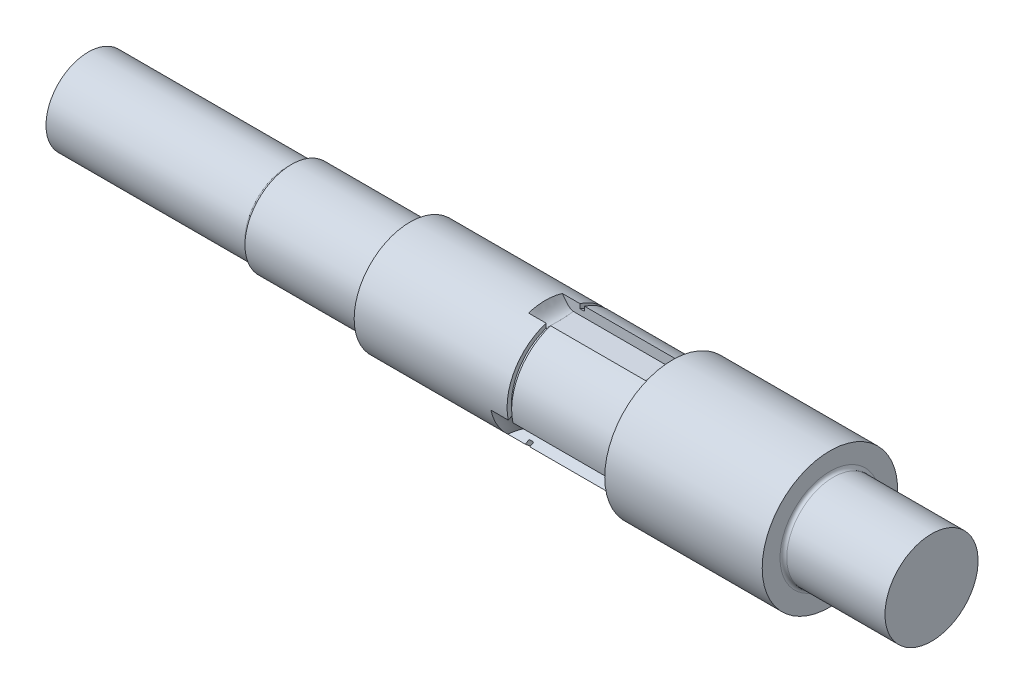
ISO-10303-21;
HEADER;
FILE_DESCRIPTION(('STEP AP214'),'2;1');
FILE_NAME('part.step','',(''),(''),'','','');
FILE_SCHEMA(('AUTOMOTIVE_DESIGN { 1 0 10303 214 1 1 1 1 }'));
ENDSEC;
DATA;
#1=APPLICATION_CONTEXT('core data for automotive mechanical design processes');
#2=APPLICATION_PROTOCOL_DEFINITION('international standard','automotive_design',2000,#1);
#3=PRODUCT_CONTEXT('',#1,'mechanical');
#4=PRODUCT('Part','Part','',(#3));
#5=PRODUCT_RELATED_PRODUCT_CATEGORY('part','',(#4));
#6=PRODUCT_DEFINITION_FORMATION('','',#4);
#7=PRODUCT_DEFINITION_CONTEXT('part definition',#1,'design');
#8=PRODUCT_DEFINITION('design','',#6,#7);
#9=PRODUCT_DEFINITION_SHAPE('','',#8);
#10=(LENGTH_UNIT() NAMED_UNIT(*) SI_UNIT(.MILLI.,.METRE.));
#11=(NAMED_UNIT(*) PLANE_ANGLE_UNIT() SI_UNIT($,.RADIAN.));
#12=(NAMED_UNIT(*) SI_UNIT($,.STERADIAN.) SOLID_ANGLE_UNIT());
#13=UNCERTAINTY_MEASURE_WITH_UNIT(LENGTH_MEASURE(1.E-05),#10,'distance_accuracy_value','');
#14=(GEOMETRIC_REPRESENTATION_CONTEXT(3) GLOBAL_UNCERTAINTY_ASSIGNED_CONTEXT((#13)) GLOBAL_UNIT_ASSIGNED_CONTEXT((#10,
#11,#12)) REPRESENTATION_CONTEXT('',''));
#15=CARTESIAN_POINT('',(0.,0.,0.));
#16=DIRECTION('',(0.,0.,1.));
#17=DIRECTION('',(1.,0.,0.));
#18=AXIS2_PLACEMENT_3D('',#15,#16,#17);
#19=CARTESIAN_POINT('',(0.,0.,0.));
#20=DIRECTION('',(-1.,0.,0.));
#21=DIRECTION('',(0.,0.,1.));
#22=AXIS2_PLACEMENT_3D('',#19,#20,#21);
#23=CYLINDRICAL_SURFACE('',#22,33.);
#24=CARTESIAN_POINT('',(223.,33.,0.));
#25=CARTESIAN_POINT('',(222.999928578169,32.9999953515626,-0.418158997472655));
#26=CARTESIAN_POINT('',(222.999997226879,32.9921734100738,-0.83632217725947));
#27=CARTESIAN_POINT('',(222.999904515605,32.9608054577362,-1.67224988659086));
#28=CARTESIAN_POINT('',(222.999743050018,32.9372522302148,-2.09001414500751));
#29=CARTESIAN_POINT('',(222.99867807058,32.8742718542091,-2.92515048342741));
#30=CARTESIAN_POINT('',(222.997773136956,32.8348144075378,-3.3425202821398));
#31=CARTESIAN_POINT('',(222.99418185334,32.7397723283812,-4.1768728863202));
#32=CARTESIAN_POINT('',(222.991489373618,32.6841325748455,-4.5938493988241));
#33=CARTESIAN_POINT('',(222.982859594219,32.5564082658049,-5.42742455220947));
#34=CARTESIAN_POINT('',(222.976905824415,32.4842413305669,-5.84401043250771));
#35=CARTESIAN_POINT('',(222.959778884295,32.3231400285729,-6.67681549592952));
#36=CARTESIAN_POINT('',(222.948569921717,32.2340932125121,-7.09301224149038));
#37=CARTESIAN_POINT('',(222.918435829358,32.0389374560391,-7.92505920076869));
#38=CARTESIAN_POINT('',(222.899442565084,31.9326829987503,-8.34087300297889));
#39=CARTESIAN_POINT('',(222.850571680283,31.7030995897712,-9.17216306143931));
#40=CARTESIAN_POINT('',(222.820573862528,31.5795917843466,-9.58758275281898));
#41=CARTESIAN_POINT('',(222.783654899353,31.4483703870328,-9.99999999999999));
#42=B_SPLINE_CURVE_WITH_KNOTS('',3,(#24,#25,#26,#27,#28,#29,#30,#31,#32,#33,#34,#35,#36,#37,#38,
#39,#40,#41),.UNSPECIFIED.,.F.,.F.,(4,2,2,2,2,2,2,2,4),(0.,1.25441039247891,2.5093966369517,
3.7667850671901,5.02850767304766,6.29666176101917,7.57358138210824,8.86192478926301,
10.164780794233),.UNSPECIFIED.);
#43=CARTESIAN_POINT('',(222.783654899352,31.4483703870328,-10.));
#44=VERTEX_POINT('',#43);
#45=CARTESIAN_POINT('',(223.,33.,0.));
#46=VERTEX_POINT('',#45);
#47=EDGE_CURVE('E725',#44,#46,#42,.F.);
#48=ORIENTED_EDGE('',*,*,#47,.T.);
#49=CARTESIAN_POINT('',(223.,0.,0.));
#50=DIRECTION('',(1.,0.,0.));
#51=DIRECTION('',(0.,0.,-1.));
#52=AXIS2_PLACEMENT_3D('',#49,#50,#51);
#53=CIRCLE('',#52,33.);
#54=CARTESIAN_POINT('',(223.,-16.5000000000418,-28.5788383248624));
#55=VERTEX_POINT('',#54);
#56=EDGE_CURVE('E904',#46,#55,#53,.F.);
#57=ORIENTED_EDGE('',*,*,#56,.T.);
#58=CARTESIAN_POINT('',(222.783654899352,-7.0639311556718,-32.2350876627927));
#59=CARTESIAN_POINT('',(222.820573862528,-7.4867056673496,-32.1425201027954));
#60=CARTESIAN_POINT('',(222.850571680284,-7.90822357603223,-32.041771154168));
#61=CARTESIAN_POINT('',(222.899442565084,-8.74293358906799,-31.8249511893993));
#62=CARTESIAN_POINT('',(222.918435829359,-9.15616613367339,-31.7090633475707));
#63=CARTESIAN_POINT('',(222.948569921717,-9.97431781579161,-31.4620497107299));
#64=CARTESIAN_POINT('',(222.959778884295,-10.3792781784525,-31.3310681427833));
#65=CARTESIAN_POINT('',(222.976905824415,-11.1810591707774,-31.0541834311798));
#66=CARTESIAN_POINT('',(222.982859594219,-11.5779165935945,-30.9083888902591));
#67=CARTESIAN_POINT('',(222.991489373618,-12.3636760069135,-30.6022138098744));
#68=CARTESIAN_POINT('',(222.994181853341,-12.7526081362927,-30.4419109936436));
#69=CARTESIAN_POINT('',(222.997773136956,-13.5226997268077,-30.1070435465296));
#70=CARTESIAN_POINT('',(222.99867807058,-13.9038812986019,-29.9325297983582));
#71=CARTESIAN_POINT('',(222.999743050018,-14.6586207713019,-29.5695042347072));
#72=CARTESIAN_POINT('',(222.999904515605,-15.0321918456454,-29.3810197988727));
#73=CARTESIAN_POINT('',(222.999997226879,-15.7718104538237,-28.9902213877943));
#74=CARTESIAN_POINT('',(222.999928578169,-16.1378613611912,-28.7879137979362));
#75=CARTESIAN_POINT('',(223.,-16.5000000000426,-28.5788383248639));
#76=B_SPLINE_CURVE_WITH_KNOTS('',3,(#58,#59,#60,#61,#62,#63,#64,#65,#66,#67,#68,#69,#70,#71,#72,
#73,#74,#75),.UNSPECIFIED.,.F.,.F.,(4,2,2,2,2,2,2,2,4),(0.,1.30285600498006,2.59119941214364,
3.86811903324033,5.13627312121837,6.39799572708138,7.65538415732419,8.91037040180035,
10.1647807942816),.UNSPECIFIED.);
#77=CARTESIAN_POINT('',(222.783654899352,-7.06393115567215,-32.2350876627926));
#78=VERTEX_POINT('',#77);
#79=EDGE_CURVE('E702',#55,#78,#76,.F.);
#80=ORIENTED_EDGE('',*,*,#79,.T.);
#81=DIRECTION('',(-1.,0.,0.));
#82=VECTOR('',#81,1.);
#83=CARTESIAN_POINT('',(0.,-7.06393115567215,-32.2350876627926));
#84=LINE('',#83,#82);
#85=CARTESIAN_POINT('',(163.,-7.06393115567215,-32.2350876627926));
#86=VERTEX_POINT('',#85);
#87=EDGE_CURVE('E362',#86,#78,#84,.F.);
#88=ORIENTED_EDGE('',*,*,#87,.F.);
#89=CARTESIAN_POINT('',(163.,0.,0.));
#90=DIRECTION('',(-1.,0.,0.));
#91=DIRECTION('',(0.,0.,1.));
#92=AXIS2_PLACEMENT_3D('',#89,#90,#91);
#93=CIRCLE('',#92,33.);
#94=CARTESIAN_POINT('',(163.,31.4483703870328,-10.));
#95=VERTEX_POINT('',#94);
#96=EDGE_CURVE('E774',#95,#86,#93,.T.);
#97=ORIENTED_EDGE('',*,*,#96,.F.);
#98=DIRECTION('',(-1.,0.,0.));
#99=VECTOR('',#98,1.);
#100=CARTESIAN_POINT('',(0.,31.4483703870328,-10.));
#101=LINE('',#100,#99);
#102=EDGE_CURVE('E577',#44,#95,#101,.T.);
#103=ORIENTED_EDGE('',*,*,#102,.F.);
#104=EDGE_LOOP('',(#48,#57,#80,#88,#97,#103));
#105=FACE_BOUND('',#104,.T.);
#106=ADVANCED_FACE('F51',(#105),#23,.T.);
#107=CARTESIAN_POINT('',(223.,-16.5000000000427,-28.5788383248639));
#108=CARTESIAN_POINT('',(222.999928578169,-16.8621339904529,-28.3697548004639));
#109=CARTESIAN_POINT('',(222.999997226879,-17.2203629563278,-28.1538992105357));
#110=CARTESIAN_POINT('',(222.999904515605,-17.928613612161,-27.7087699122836));
#111=CARTESIAN_POINT('',(222.999743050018,-18.2786314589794,-27.479490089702));
#112=CARTESIAN_POINT('',(222.99867807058,-18.9703905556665,-27.0073793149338));
#113=CARTESIAN_POINT('',(222.997773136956,-19.3121146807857,-26.764523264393));
#114=CARTESIAN_POINT('',(222.99418185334,-19.987164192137,-26.265038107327));
#115=CARTESIAN_POINT('',(222.991489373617,-20.3204565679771,-26.008364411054));
#116=CARTESIAN_POINT('',(222.982859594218,-20.9784916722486,-25.4809643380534));
#117=CARTESIAN_POINT('',(222.976905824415,-21.3031821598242,-25.2101729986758));
#118=CARTESIAN_POINT('',(222.959778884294,-21.9438618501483,-24.6542526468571));
#119=CARTESIAN_POINT('',(222.948569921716,-22.2597753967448,-24.3690374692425));
#120=CARTESIAN_POINT('',(222.918435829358,-22.8827713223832,-23.7840041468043));
#121=CARTESIAN_POINT('',(222.899442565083,-23.1897494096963,-23.4840781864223));
#122=CARTESIAN_POINT('',(222.850571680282,-23.794876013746,-22.8696080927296));
#123=CARTESIAN_POINT('',(222.820573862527,-24.0928861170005,-22.5549373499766));
#124=CARTESIAN_POINT('',(222.783654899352,-24.3844392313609,-22.2350876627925));
#125=B_SPLINE_CURVE_WITH_KNOTS('',3,(#107,#108,#109,#110,#111,#112,#113,#114,#115,#116,#117,
#118,#119,#120,#121,#122,#123,#124),.UNSPECIFIED.,.F.,.F.,(4,2,2,2,2,2,2,2,4),(0.,
1.2544103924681,2.5093966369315,3.76678506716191,5.02850767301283,6.29666176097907,
7.57358138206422,8.86192478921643,10.1647807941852),.UNSPECIFIED.);
#126=CARTESIAN_POINT('',(222.783654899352,-24.3844392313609,-22.2350876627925));
#127=VERTEX_POINT('',#126);
#128=EDGE_CURVE('E266',#127,#55,#125,.F.);
#129=ORIENTED_EDGE('',*,*,#128,.T.);
#130=CARTESIAN_POINT('',(223.,0.,0.));
#131=DIRECTION('',(1.,0.,0.));
#132=DIRECTION('',(0.,0.,-1.));
#133=AXIS2_PLACEMENT_3D('',#130,#131,#132);
#134=CIRCLE('',#133,33.);
#135=CARTESIAN_POINT('',(223.,-16.5000000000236,28.5788383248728));
#136=VERTEX_POINT('',#135);
#137=EDGE_CURVE('E67',#55,#136,#134,.F.);
#138=ORIENTED_EDGE('',*,*,#137,.T.);
#139=CARTESIAN_POINT('',(222.783654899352,-24.3844392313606,22.2350876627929));
#140=CARTESIAN_POINT('',(222.820573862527,-24.0928861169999,22.5549373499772));
#141=CARTESIAN_POINT('',(222.850571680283,-23.7948760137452,22.8696080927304));
#142=CARTESIAN_POINT('',(222.899442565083,-23.1897494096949,23.4840781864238));
#143=CARTESIAN_POINT('',(222.918435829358,-22.8827713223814,23.7840041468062));
#144=CARTESIAN_POINT('',(222.948569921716,-22.2597753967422,24.3690374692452));
#145=CARTESIAN_POINT('',(222.959778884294,-21.9438618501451,24.6542526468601));
#146=CARTESIAN_POINT('',(222.976905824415,-21.3031821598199,25.2101729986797));
#147=CARTESIAN_POINT('',(222.982859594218,-20.9784916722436,25.4809643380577));
#148=CARTESIAN_POINT('',(222.991489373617,-20.3204565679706,26.0083644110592));
#149=CARTESIAN_POINT('',(222.99418185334,-19.9871641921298,26.2650381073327));
#150=CARTESIAN_POINT('',(222.997773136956,-19.3121146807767,26.7645232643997));
#151=CARTESIAN_POINT('',(222.99867807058,-18.9703905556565,27.0073793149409));
#152=CARTESIAN_POINT('',(222.999743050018,-18.2786314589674,27.4794900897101));
#153=CARTESIAN_POINT('',(222.999904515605,-17.9286136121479,27.7087699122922));
#154=CARTESIAN_POINT('',(222.999997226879,-17.2203629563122,28.1538992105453));
#155=CARTESIAN_POINT('',(222.999928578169,-16.862133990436,28.369754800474));
#156=CARTESIAN_POINT('',(223.,-16.5000000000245,28.5788383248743));
#157=B_SPLINE_CURVE_WITH_KNOTS('',3,(#139,#140,#141,#142,#143,#144,#145,#146,#147,#148,#149,
#150,#151,#152,#153,#154,#155,#156),.UNSPECIFIED.,.F.,.F.,(4,2,2,2,2,2,2,2,4),(0.,
1.30285600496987,2.59119941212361,3.8681190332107,5.13627312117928,6.39799572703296,
7.65538415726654,8.91037040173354,10.1647807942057),.UNSPECIFIED.);
#158=CARTESIAN_POINT('',(222.783654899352,-24.3844392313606,22.2350876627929));
#159=VERTEX_POINT('',#158);
#160=EDGE_CURVE('E325',#136,#159,#157,.F.);
#161=ORIENTED_EDGE('',*,*,#160,.T.);
#162=DIRECTION('',(-1.,0.,0.));
#163=VECTOR('',#162,1.);
#164=CARTESIAN_POINT('',(0.,-24.3844392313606,22.2350876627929));
#165=LINE('',#164,#163);
#166=CARTESIAN_POINT('',(163.,-24.3844392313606,22.2350876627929));
#167=VERTEX_POINT('',#166);
#168=EDGE_CURVE('E239',#167,#159,#165,.F.);
#169=ORIENTED_EDGE('',*,*,#168,.F.);
#170=CARTESIAN_POINT('',(163.,-24.3844392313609,-22.2350876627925));
#171=VERTEX_POINT('',#170);
#172=EDGE_CURVE('E777',#171,#167,#93,.T.);
#173=ORIENTED_EDGE('',*,*,#172,.F.);
#174=DIRECTION('',(-1.,0.,0.));
#175=VECTOR('',#174,1.);
#176=CARTESIAN_POINT('',(0.,-24.3844392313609,-22.2350876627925));
#177=LINE('',#176,#175);
#178=EDGE_CURVE('E719',#127,#171,#177,.T.);
#179=ORIENTED_EDGE('',*,*,#178,.F.);
#180=EDGE_LOOP('',(#129,#138,#161,#169,#173,#179));
#181=FACE_BOUND('',#180,.T.);
#182=ADVANCED_FACE('F388',(#181),#23,.T.);
#183=CARTESIAN_POINT('',(0.,0.,0.));
#184=DIRECTION('',(-1.,0.,0.));
#185=DIRECTION('',(0.,0.,1.));
#186=AXIS2_PLACEMENT_3D('',#183,#184,#185);
#187=CYLINDRICAL_SURFACE('',#186,33.);
#188=CARTESIAN_POINT('',(70.,0.,0.));
#189=DIRECTION('',(-1.,0.,0.));
#190=DIRECTION('',(0.,0.,1.));
#191=AXIS2_PLACEMENT_3D('',#188,#189,#190);
#192=CIRCLE('',#191,33.);
#193=CARTESIAN_POINT('',(70.,0.,33.));
#194=VERTEX_POINT('',#193);
#195=EDGE_CURVE('E745',#194,#194,#192,.T.);
#196=ORIENTED_EDGE('',*,*,#195,.F.);
#197=EDGE_LOOP('',(#196));
#198=FACE_BOUND('',#197,.T.);
#199=DIRECTION('',(-1.,0.,0.));
#200=VECTOR('',#199,1.);
#201=CARTESIAN_POINT('',(0.,-7.06393115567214,-32.2350876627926));
#202=LINE('',#201,#200);
#203=CARTESIAN_POINT('',(149.999996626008,-7.06389360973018,-32.2350226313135));
#204=VERTEX_POINT('',#203);
#205=CARTESIAN_POINT('',(160.33,-7.06393115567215,-32.2350876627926));
#206=VERTEX_POINT('',#205);
#207=EDGE_CURVE('E521',#204,#206,#202,.F.);
#208=ORIENTED_EDGE('',*,*,#207,.F.);
#209=CARTESIAN_POINT('',(150.,-25.010468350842,-21.5285037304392));
#210=CARTESIAN_POINT('',(150.,-23.8929140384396,-22.8268083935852));
#211=CARTESIAN_POINT('',(150.,-22.6083677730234,-24.1111229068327));
#212=CARTESIAN_POINT('',(150.,-19.7450859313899,-26.5069070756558));
#213=CARTESIAN_POINT('',(150.,-18.1660493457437,-27.6169442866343));
#214=CARTESIAN_POINT('',(150.,-14.8339506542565,-29.5407323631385));
#215=CARTESIAN_POINT('',(150.,-13.0831119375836,-30.3531995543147));
#216=CARTESIAN_POINT('',(150.,-9.57666106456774,-31.6349822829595));
#217=CARTESIAN_POINT('',(150.,-7.82213893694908,-32.1052747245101));
#218=CARTESIAN_POINT('',(150.,-6.13899696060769,-32.4239528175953));
#219=(BOUNDED_CURVE() B_SPLINE_CURVE(3,(#209,#210,#211,#212,#213,#214,#215,#216,#217,#218),
.UNSPECIFIED.,.F.,.F.) B_SPLINE_CURVE_WITH_KNOTS((4,2,2,2,4),(-0.00241717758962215,
0.00379141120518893,0.01,0.0162085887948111,0.0224171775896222),
.UNSPECIFIED.) CURVE() GEOMETRIC_REPRESENTATION_ITEM() RATIONAL_B_SPLINE_CURVE((1.,1.,1.,1.,1.,
1.,1.,1.,1.,1.)) REPRESENTATION_ITEM(''));
#220=CARTESIAN_POINT('',(149.999993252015,-24.3843641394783,-22.2349575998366));
#221=VERTEX_POINT('',#220);
#222=EDGE_CURVE('E361',#221,#204,#219,.T.);
#223=ORIENTED_EDGE('',*,*,#222,.F.);
#224=DIRECTION('',(-1.,0.,0.));
#225=VECTOR('',#224,1.);
#226=CARTESIAN_POINT('',(0.,-24.3844392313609,-22.2350876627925));
#227=LINE('',#226,#225);
#228=CARTESIAN_POINT('',(160.33,-24.3844392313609,-22.2350876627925));
#229=VERTEX_POINT('',#228);
#230=EDGE_CURVE('E511',#229,#221,#227,.T.);
#231=ORIENTED_EDGE('',*,*,#230,.F.);
#232=CARTESIAN_POINT('',(160.33,0.,0.));
#233=DIRECTION('',(-1.,0.,0.));
#234=DIRECTION('',(0.,0.,1.));
#235=AXIS2_PLACEMENT_3D('',#232,#233,#234);
#236=CIRCLE('',#235,33.);
#237=CARTESIAN_POINT('',(160.33,-24.3844392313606,22.2350876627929));
#238=VERTEX_POINT('',#237);
#239=EDGE_CURVE('E353',#229,#238,#236,.T.);
#240=ORIENTED_EDGE('',*,*,#239,.T.);
#241=DIRECTION('',(-1.,0.,0.));
#242=VECTOR('',#241,1.);
#243=CARTESIAN_POINT('',(0.,-24.3844392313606,22.2350876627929));
#244=LINE('',#243,#242);
#245=CARTESIAN_POINT('',(149.999996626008,-24.3844016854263,22.2350226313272));
#246=VERTEX_POINT('',#245);
#247=EDGE_CURVE('E342',#246,#238,#244,.F.);
#248=ORIENTED_EDGE('',*,*,#247,.F.);
#249=CARTESIAN_POINT('',(150.,-6.13899696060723,32.4239528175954));
#250=CARTESIAN_POINT('',(150.,-7.82213893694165,32.1052747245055));
#251=CARTESIAN_POINT('',(150.,-9.576661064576,31.6349822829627));
#252=CARTESIAN_POINT('',(150.,-13.0831119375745,30.3531995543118));
#253=CARTESIAN_POINT('',(150.,-14.8339506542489,29.5407323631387));
#254=CARTESIAN_POINT('',(150.,-18.1660493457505,27.6169442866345));
#255=CARTESIAN_POINT('',(150.,-19.7450859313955,26.5069070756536));
#256=CARTESIAN_POINT('',(150.,-22.6083677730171,24.1111229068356));
#257=CARTESIAN_POINT('',(150.,-23.8929140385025,22.8268083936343));
#258=CARTESIAN_POINT('',(150.,-25.0104683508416,21.5285037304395));
#259=(BOUNDED_CURVE() B_SPLINE_CURVE(3,(#249,#250,#251,#252,#253,#254,#255,#256,#257,#258),
.UNSPECIFIED.,.F.,.F.) B_SPLINE_CURVE_WITH_KNOTS((4,2,2,2,4),(-0.00241717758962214,
0.00379141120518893,0.01,0.0162085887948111,0.0224171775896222),
.UNSPECIFIED.) CURVE() GEOMETRIC_REPRESENTATION_ITEM() RATIONAL_B_SPLINE_CURVE((1.,1.,1.,1.,1.,
1.,1.,1.,1.,1.)) REPRESENTATION_ITEM(''));
#260=CARTESIAN_POINT('',(149.999993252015,-7.06385606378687,32.2349575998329));
#261=VERTEX_POINT('',#260);
#262=EDGE_CURVE('E90',#261,#246,#259,.T.);
#263=ORIENTED_EDGE('',*,*,#262,.F.);
#264=DIRECTION('',(-1.,0.,0.));
#265=VECTOR('',#264,1.);
#266=CARTESIAN_POINT('',(0.,-7.0639311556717,32.2350876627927));
#267=LINE('',#266,#265);
#268=CARTESIAN_POINT('',(160.33,-7.0639311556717,32.2350876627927));
#269=VERTEX_POINT('',#268);
#270=EDGE_CURVE('E494',#269,#261,#267,.T.);
#271=ORIENTED_EDGE('',*,*,#270,.F.);
#272=CARTESIAN_POINT('',(160.33,31.4483703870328,10.));
#273=VERTEX_POINT('',#272);
#274=EDGE_CURVE('E753',#269,#273,#236,.T.);
#275=ORIENTED_EDGE('',*,*,#274,.T.);
#276=DIRECTION('',(-1.,0.,0.));
#277=VECTOR('',#276,1.);
#278=CARTESIAN_POINT('',(0.,31.4483703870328,9.99999999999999));
#279=LINE('',#278,#277);
#280=CARTESIAN_POINT('',(149.999996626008,31.4482952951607,10.));
#281=VERTEX_POINT('',#280);
#282=EDGE_CURVE('E794',#281,#273,#279,.F.);
#283=ORIENTED_EDGE('',*,*,#282,.F.);
#284=CARTESIAN_POINT('',(150.,31.1494653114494,-10.8954490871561));
#285=CARTESIAN_POINT('',(150.,31.7150529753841,-9.27846633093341));
#286=CARTESIAN_POINT('',(150.,32.1850288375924,-7.52385937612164));
#287=CARTESIAN_POINT('',(150.,32.8281978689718,-3.84629247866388));
#288=CARTESIAN_POINT('',(150.,33.,-1.92378807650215));
#289=CARTESIAN_POINT('',(150.,33.,1.92378807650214));
#290=CARTESIAN_POINT('',(150.,32.828197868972,3.84629247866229));
#291=CARTESIAN_POINT('',(150.,32.1850288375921,7.52385937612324));
#292=CARTESIAN_POINT('',(150.,31.7150529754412,9.27846633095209));
#293=CARTESIAN_POINT('',(150.,31.1494653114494,10.8954490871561));
#294=(BOUNDED_CURVE() B_SPLINE_CURVE(3,(#284,#285,#286,#287,#288,#289,#290,#291,#292,#293),
.UNSPECIFIED.,.F.,.F.) B_SPLINE_CURVE_WITH_KNOTS((4,2,2,2,4),(-0.00241717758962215,
0.00379141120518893,0.01,0.0162085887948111,0.0224171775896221),
.UNSPECIFIED.) CURVE() GEOMETRIC_REPRESENTATION_ITEM() RATIONAL_B_SPLINE_CURVE((1.,1.,1.,1.,1.,
1.,1.,1.,1.,1.)) REPRESENTATION_ITEM(''));
#295=CARTESIAN_POINT('',(149.999993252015,31.448220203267,-10.));
#296=VERTEX_POINT('',#295);
#297=EDGE_CURVE('E576',#296,#281,#294,.T.);
#298=ORIENTED_EDGE('',*,*,#297,.F.);
#299=DIRECTION('',(-1.,0.,0.));
#300=VECTOR('',#299,1.);
#301=CARTESIAN_POINT('',(0.,31.4483703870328,-10.));
#302=LINE('',#301,#300);
#303=CARTESIAN_POINT('',(160.33,31.4483703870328,-10.));
#304=VERTEX_POINT('',#303);
#305=EDGE_CURVE('E599',#304,#296,#302,.T.);
#306=ORIENTED_EDGE('',*,*,#305,.F.);
#307=EDGE_CURVE('E748',#304,#206,#236,.T.);
#308=ORIENTED_EDGE('',*,*,#307,.T.);
#309=EDGE_LOOP('',(#208,#223,#231,#240,#248,#263,#271,#275,#283,#298,#306,#308));
#310=FACE_BOUND('',#309,.T.);
#311=ADVANCED_FACE('F350',(#198,#310),#187,.T.);
#312=CARTESIAN_POINT('',(160.33,33.,0.));
#313=DIRECTION('',(-1.,0.,0.));
#314=DIRECTION('',(0.,0.,1.));
#315=AXIS2_PLACEMENT_3D('',#312,#313,#314);
#316=PLANE('',#315);
#317=DIRECTION('',(0.,0.500000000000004,0.866025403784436));
#318=VECTOR('',#317,1.);
#319=CARTESIAN_POINT('',(160.33,16.9102540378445,9.28941916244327));
#320=LINE('',#319,#318);
#321=CARTESIAN_POINT('',(160.33,-5.74677549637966,-29.9537071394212));
#322=VERTEX_POINT('',#321);
#323=EDGE_CURVE('E518',#206,#322,#320,.T.);
#324=ORIENTED_EDGE('',*,*,#323,.F.);
#325=ORIENTED_EDGE('',*,*,#307,.F.);
#326=DIRECTION('',(0.,1.,0.));
#327=VECTOR('',#326,1.);
#328=CARTESIAN_POINT('',(160.33,33.,-10.));
#329=LINE('',#328,#327);
#330=CARTESIAN_POINT('',(160.33,28.8140590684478,-10.));
#331=VERTEX_POINT('',#330);
#332=EDGE_CURVE('E609',#331,#304,#329,.T.);
#333=ORIENTED_EDGE('',*,*,#332,.F.);
#334=CARTESIAN_POINT('',(160.33,0.,0.));
#335=DIRECTION('',(-1.,0.,0.));
#336=DIRECTION('',(0.,0.,1.));
#337=AXIS2_PLACEMENT_3D('',#334,#335,#336);
#338=CIRCLE('',#337,30.5);
#339=EDGE_CURVE('E756',#331,#322,#338,.T.);
#340=ORIENTED_EDGE('',*,*,#339,.T.);
#341=EDGE_LOOP('',(#324,#325,#333,#340));
#342=FACE_BOUND('',#341,.T.);
#343=ADVANCED_FACE('F387',(#342),#316,.F.);
#344=DIRECTION('',(0.,-0.500000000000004,-0.866025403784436));
#345=VECTOR('',#344,1.);
#346=CARTESIAN_POINT('',(160.33,-0.41025403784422,19.2894191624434));
#347=LINE('',#346,#345);
#348=CARTESIAN_POINT('',(160.33,-23.0672835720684,-19.9537071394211));
#349=VERTEX_POINT('',#348);
#350=EDGE_CURVE('E508',#349,#229,#347,.T.);
#351=ORIENTED_EDGE('',*,*,#350,.F.);
#352=CARTESIAN_POINT('',(160.33,-23.0672835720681,19.9537071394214));
#353=VERTEX_POINT('',#352);
#354=EDGE_CURVE('E759',#349,#353,#338,.T.);
#355=ORIENTED_EDGE('',*,*,#354,.T.);
#356=DIRECTION('',(0.,0.499999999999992,-0.866025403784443));
#357=VECTOR('',#356,1.);
#358=CARTESIAN_POINT('',(160.33,-0.410254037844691,-19.289419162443));
#359=LINE('',#358,#357);
#360=EDGE_CURVE('E356',#238,#353,#359,.T.);
#361=ORIENTED_EDGE('',*,*,#360,.F.);
#362=ORIENTED_EDGE('',*,*,#239,.F.);
#363=EDGE_LOOP('',(#351,#355,#361,#362));
#364=FACE_BOUND('',#363,.T.);
#365=ADVANCED_FACE('F1112',(#364),#316,.F.);
#366=DIRECTION('',(0.,-0.499999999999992,0.866025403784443));
#367=VECTOR('',#366,1.);
#368=CARTESIAN_POINT('',(160.33,16.9102540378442,-9.28941916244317));
#369=LINE('',#368,#367);
#370=CARTESIAN_POINT('',(160.33,-5.74677549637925,29.9537071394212));
#371=VERTEX_POINT('',#370);
#372=EDGE_CURVE('E491',#371,#269,#369,.T.);
#373=ORIENTED_EDGE('',*,*,#372,.F.);
#374=CARTESIAN_POINT('',(160.33,28.8140590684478,9.99999999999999));
#375=VERTEX_POINT('',#374);
#376=EDGE_CURVE('E761',#371,#375,#338,.T.);
#377=ORIENTED_EDGE('',*,*,#376,.T.);
#378=DIRECTION('',(0.,-1.,0.));
#379=VECTOR('',#378,1.);
#380=CARTESIAN_POINT('',(160.33,33.,10.));
#381=LINE('',#380,#379);
#382=EDGE_CURVE('E798',#273,#375,#381,.T.);
#383=ORIENTED_EDGE('',*,*,#382,.F.);
#384=ORIENTED_EDGE('',*,*,#274,.F.);
#385=EDGE_LOOP('',(#373,#377,#383,#384));
#386=FACE_BOUND('',#385,.T.);
#387=ADVANCED_FACE('F1114',(#386),#316,.F.);
#388=CARTESIAN_POINT('',(0.,0.,0.));
#389=DIRECTION('',(-1.,0.,0.));
#390=DIRECTION('',(0.,0.,1.));
#391=AXIS2_PLACEMENT_3D('',#388,#389,#390);
#392=CYLINDRICAL_SURFACE('',#391,30.5);
#393=DIRECTION('',(-1.,0.,0.));
#394=VECTOR('',#393,1.);
#395=CARTESIAN_POINT('',(0.,-5.74677549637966,-29.9537071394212));
#396=LINE('',#395,#394);
#397=CARTESIAN_POINT('',(163.,-5.74677549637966,-29.9537071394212));
#398=VERTEX_POINT('',#397);
#399=EDGE_CURVE('E515',#322,#398,#396,.F.);
#400=ORIENTED_EDGE('',*,*,#399,.F.);
#401=ORIENTED_EDGE('',*,*,#339,.F.);
#402=DIRECTION('',(-1.,0.,0.));
#403=VECTOR('',#402,1.);
#404=CARTESIAN_POINT('',(0.,28.8140590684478,-10.));
#405=LINE('',#404,#403);
#406=CARTESIAN_POINT('',(163.,28.8140590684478,-10.));
#407=VERTEX_POINT('',#406);
#408=EDGE_CURVE('E811',#407,#331,#405,.T.);
#409=ORIENTED_EDGE('',*,*,#408,.F.);
#410=CARTESIAN_POINT('',(163.,0.,0.));
#411=DIRECTION('',(-1.,0.,0.));
#412=DIRECTION('',(0.,0.,1.));
#413=AXIS2_PLACEMENT_3D('',#410,#411,#412);
#414=CIRCLE('',#413,30.5);
#415=EDGE_CURVE('E765',#407,#398,#414,.T.);
#416=ORIENTED_EDGE('',*,*,#415,.T.);
#417=EDGE_LOOP('',(#400,#401,#409,#416));
#418=FACE_BOUND('',#417,.T.);
#419=ADVANCED_FACE('F915',(#418),#392,.T.);
#420=DIRECTION('',(-1.,0.,0.));
#421=VECTOR('',#420,1.);
#422=CARTESIAN_POINT('',(0.,-23.0672835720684,-19.9537071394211));
#423=LINE('',#422,#421);
#424=CARTESIAN_POINT('',(163.,-23.0672835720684,-19.9537071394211));
#425=VERTEX_POINT('',#424);
#426=EDGE_CURVE('E505',#425,#349,#423,.T.);
#427=ORIENTED_EDGE('',*,*,#426,.F.);
#428=CARTESIAN_POINT('',(163.,-23.0672835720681,19.9537071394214));
#429=VERTEX_POINT('',#428);
#430=EDGE_CURVE('E768',#425,#429,#414,.T.);
#431=ORIENTED_EDGE('',*,*,#430,.T.);
#432=DIRECTION('',(-1.,0.,0.));
#433=VECTOR('',#432,1.);
#434=CARTESIAN_POINT('',(0.,-23.0672835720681,19.9537071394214));
#435=LINE('',#434,#433);
#436=EDGE_CURVE('E498',#353,#429,#435,.F.);
#437=ORIENTED_EDGE('',*,*,#436,.F.);
#438=ORIENTED_EDGE('',*,*,#354,.F.);
#439=EDGE_LOOP('',(#427,#431,#437,#438));
#440=FACE_BOUND('',#439,.T.);
#441=ADVANCED_FACE('F1108',(#440),#392,.T.);
#442=DIRECTION('',(-1.,0.,0.));
#443=VECTOR('',#442,1.);
#444=CARTESIAN_POINT('',(0.,-5.74677549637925,29.9537071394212));
#445=LINE('',#444,#443);
#446=CARTESIAN_POINT('',(163.,-5.74677549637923,29.9537071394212));
#447=VERTEX_POINT('',#446);
#448=EDGE_CURVE('E487',#447,#371,#445,.T.);
#449=ORIENTED_EDGE('',*,*,#448,.F.);
#450=CARTESIAN_POINT('',(163.,28.8140590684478,10.));
#451=VERTEX_POINT('',#450);
#452=EDGE_CURVE('E770',#447,#451,#414,.T.);
#453=ORIENTED_EDGE('',*,*,#452,.T.);
#454=DIRECTION('',(-1.,0.,0.));
#455=VECTOR('',#454,1.);
#456=CARTESIAN_POINT('',(0.,28.8140590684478,9.99999999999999));
#457=LINE('',#456,#455);
#458=EDGE_CURVE('E802',#375,#451,#457,.F.);
#459=ORIENTED_EDGE('',*,*,#458,.F.);
#460=ORIENTED_EDGE('',*,*,#376,.F.);
#461=EDGE_LOOP('',(#449,#453,#459,#460));
#462=FACE_BOUND('',#461,.T.);
#463=ADVANCED_FACE('F1328',(#462),#392,.T.);
#464=CARTESIAN_POINT('',(163.,30.5,0.));
#465=DIRECTION('',(1.,0.,0.));
#466=DIRECTION('',(0.,0.,-1.));
#467=AXIS2_PLACEMENT_3D('',#464,#465,#466);
#468=PLANE('',#467);
#469=DIRECTION('',(0.,-0.500000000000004,-0.866025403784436));
#470=VECTOR('',#469,1.);
#471=CARTESIAN_POINT('',(163.,16.2852540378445,8.20688740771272));
#472=LINE('',#471,#470);
#473=EDGE_CURVE('E512',#398,#86,#472,.T.);
#474=ORIENTED_EDGE('',*,*,#473,.F.);
#475=ORIENTED_EDGE('',*,*,#415,.F.);
#476=DIRECTION('',(0.,-1.,0.));
#477=VECTOR('',#476,1.);
#478=CARTESIAN_POINT('',(163.,30.5,-10.));
#479=LINE('',#478,#477);
#480=EDGE_CURVE('E814',#95,#407,#479,.T.);
#481=ORIENTED_EDGE('',*,*,#480,.F.);
#482=ORIENTED_EDGE('',*,*,#96,.T.);
#483=EDGE_LOOP('',(#474,#475,#481,#482));
#484=FACE_BOUND('',#483,.T.);
#485=ADVANCED_FACE('F647',(#484),#468,.F.);
#486=DIRECTION('',(0.,0.500000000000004,0.866025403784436));
#487=VECTOR('',#486,1.);
#488=CARTESIAN_POINT('',(163.,-1.03525403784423,18.2068874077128));
#489=LINE('',#488,#487);
#490=EDGE_CURVE('E355',#171,#425,#489,.T.);
#491=ORIENTED_EDGE('',*,*,#490,.F.);
#492=ORIENTED_EDGE('',*,*,#172,.T.);
#493=DIRECTION('',(0.,-0.499999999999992,0.866025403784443));
#494=VECTOR('',#493,1.);
#495=CARTESIAN_POINT('',(163.,-1.03525403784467,-18.2068874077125));
#496=LINE('',#495,#494);
#497=EDGE_CURVE('E495',#429,#167,#496,.T.);
#498=ORIENTED_EDGE('',*,*,#497,.F.);
#499=ORIENTED_EDGE('',*,*,#430,.F.);
#500=EDGE_LOOP('',(#491,#492,#498,#499));
#501=FACE_BOUND('',#500,.T.);
#502=ADVANCED_FACE('F1104',(#501),#468,.F.);
#503=DIRECTION('',(0.,0.499999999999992,-0.866025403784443));
#504=VECTOR('',#503,1.);
#505=CARTESIAN_POINT('',(163.,16.2852540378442,-8.20688740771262));
#506=LINE('',#505,#504);
#507=CARTESIAN_POINT('',(163.,-7.0639311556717,32.2350876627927));
#508=VERTEX_POINT('',#507);
#509=EDGE_CURVE('E484',#508,#447,#506,.T.);
#510=ORIENTED_EDGE('',*,*,#509,.F.);
#511=CARTESIAN_POINT('',(163.,31.4483703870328,9.99999999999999));
#512=VERTEX_POINT('',#511);
#513=EDGE_CURVE('E779',#508,#512,#93,.T.);
#514=ORIENTED_EDGE('',*,*,#513,.T.);
#515=DIRECTION('',(0.,1.,0.));
#516=VECTOR('',#515,1.);
#517=CARTESIAN_POINT('',(163.,30.5,10.));
#518=LINE('',#517,#516);
#519=EDGE_CURVE('E608',#451,#512,#518,.T.);
#520=ORIENTED_EDGE('',*,*,#519,.F.);
#521=ORIENTED_EDGE('',*,*,#452,.F.);
#522=EDGE_LOOP('',(#510,#514,#520,#521));
#523=FACE_BOUND('',#522,.T.);
#524=ADVANCED_FACE('F644',(#523),#468,.F.);
#525=CARTESIAN_POINT('',(223.,-16.5000000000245,28.5788383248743));
#526=CARTESIAN_POINT('',(222.999928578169,-16.1378613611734,28.7879137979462));
#527=CARTESIAN_POINT('',(222.999997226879,-15.7718104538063,28.9902213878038));
#528=CARTESIAN_POINT('',(222.999904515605,-15.0321918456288,29.3810197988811));
#529=CARTESIAN_POINT('',(222.999743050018,-14.6586207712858,29.5695042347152));
#530=CARTESIAN_POINT('',(222.99867807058,-13.9038812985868,29.9325297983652));
#531=CARTESIAN_POINT('',(222.997773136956,-13.5226997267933,30.107043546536));
#532=CARTESIAN_POINT('',(222.99418185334,-12.7526081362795,30.4419109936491));
#533=CARTESIAN_POINT('',(222.991489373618,-12.363676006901,30.6022138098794));
#534=CARTESIAN_POINT('',(222.982859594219,-11.5779165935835,30.9083888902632));
#535=CARTESIAN_POINT('',(222.976905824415,-11.1810591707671,31.0541834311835));
#536=CARTESIAN_POINT('',(222.959778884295,-10.379278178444,31.3310681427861));
#537=CARTESIAN_POINT('',(222.948569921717,-9.97431781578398,31.4620497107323));
#538=CARTESIAN_POINT('',(222.918435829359,-9.15616613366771,31.7090633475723));
#539=CARTESIAN_POINT('',(222.899442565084,-8.74293358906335,31.8249511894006));
#540=CARTESIAN_POINT('',(222.850571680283,-7.90822357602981,32.0417711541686));
#541=CARTESIAN_POINT('',(222.820573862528,-7.48670566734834,32.1425201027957));
#542=CARTESIAN_POINT('',(222.783654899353,-7.06393115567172,32.2350876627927));
#543=B_SPLINE_CURVE_WITH_KNOTS('',3,(#525,#526,#527,#528,#529,#530,#531,#532,#533,#534,#535,
#536,#537,#538,#539,#540,#541,#542),.UNSPECIFIED.,.F.,.F.,(4,2,2,2,2,2,2,2,4),(0.,
1.25441039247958,2.5093966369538,3.76678506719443,5.02850767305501,6.29666176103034,
7.57358138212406,8.86192478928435,10.1647807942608),.UNSPECIFIED.);
#544=CARTESIAN_POINT('',(222.783654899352,-7.0639311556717,32.2350876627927));
#545=VERTEX_POINT('',#544);
#546=EDGE_CURVE('E324',#545,#136,#543,.F.);
#547=ORIENTED_EDGE('',*,*,#546,.T.);
#548=CARTESIAN_POINT('',(223.,0.,0.));
#549=DIRECTION('',(1.,0.,0.));
#550=DIRECTION('',(0.,0.,-1.));
#551=AXIS2_PLACEMENT_3D('',#548,#549,#550);
#552=CIRCLE('',#551,33.);
#553=EDGE_CURVE('E1448',#136,#46,#552,.F.);
#554=ORIENTED_EDGE('',*,*,#553,.T.);
#555=CARTESIAN_POINT('',(222.783654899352,31.4483703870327,10.0000000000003));
#556=CARTESIAN_POINT('',(222.820573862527,31.5795917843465,9.58758275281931));
#557=CARTESIAN_POINT('',(222.850571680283,31.7030995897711,9.17216306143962));
#558=CARTESIAN_POINT('',(222.899442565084,31.9326829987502,8.34087300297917));
#559=CARTESIAN_POINT('',(222.918435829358,32.038937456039,7.92505920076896));
#560=CARTESIAN_POINT('',(222.948569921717,32.234093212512,7.09301224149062));
#561=CARTESIAN_POINT('',(222.959778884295,32.3231400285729,6.67681549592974));
#562=CARTESIAN_POINT('',(222.976905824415,32.4842413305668,5.84401043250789));
#563=CARTESIAN_POINT('',(222.982859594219,32.5564082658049,5.42742455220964));
#564=CARTESIAN_POINT('',(222.991489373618,32.6841325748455,4.59384939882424));
#565=CARTESIAN_POINT('',(222.99418185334,32.7397723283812,4.17687288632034));
#566=CARTESIAN_POINT('',(222.997773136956,32.8348144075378,3.3425202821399));
#567=CARTESIAN_POINT('',(222.99867807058,32.8742718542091,2.9251504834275));
#568=CARTESIAN_POINT('',(222.999743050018,32.9372522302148,2.09001414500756));
#569=CARTESIAN_POINT('',(222.999904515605,32.9608054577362,1.6722498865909));
#570=CARTESIAN_POINT('',(222.999997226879,32.9921734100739,0.83632217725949));
#571=CARTESIAN_POINT('',(222.999928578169,32.9999953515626,0.418158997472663));
#572=CARTESIAN_POINT('',(223.,33.,0.));
#573=B_SPLINE_CURVE_WITH_KNOTS('',3,(#555,#556,#557,#558,#559,#560,#561,#562,#563,#564,#565,
#566,#567,#568,#569,#570,#571,#572),.UNSPECIFIED.,.F.,.F.,(4,2,2,2,2,2,2,2,4),(0.,
1.30285600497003,2.59119941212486,3.86811903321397,5.13627312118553,6.39799572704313,
7.65538415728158,8.91037040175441,10.1647807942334),.UNSPECIFIED.);
#574=CARTESIAN_POINT('',(222.783654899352,31.4483703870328,9.99999999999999));
#575=VERTEX_POINT('',#574);
#576=EDGE_CURVE('E626',#46,#575,#573,.F.);
#577=ORIENTED_EDGE('',*,*,#576,.T.);
#578=DIRECTION('',(-1.,0.,0.));
#579=VECTOR('',#578,1.);
#580=CARTESIAN_POINT('',(0.,31.4483703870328,9.99999999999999));
#581=LINE('',#580,#579);
#582=EDGE_CURVE('E567',#512,#575,#581,.F.);
#583=ORIENTED_EDGE('',*,*,#582,.F.);
#584=ORIENTED_EDGE('',*,*,#513,.F.);
#585=DIRECTION('',(-1.,0.,0.));
#586=VECTOR('',#585,1.);
#587=CARTESIAN_POINT('',(0.,-7.0639311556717,32.2350876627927));
#588=LINE('',#587,#586);
#589=EDGE_CURVE('E96',#545,#508,#588,.T.);
#590=ORIENTED_EDGE('',*,*,#589,.F.);
#591=EDGE_LOOP('',(#547,#554,#577,#583,#584,#590));
#592=FACE_BOUND('',#591,.T.);
#593=ADVANCED_FACE('F633',(#592),#23,.T.);
#594=CARTESIAN_POINT('',(-120.,0.,0.));
#595=DIRECTION('',(1.,0.,0.));
#596=DIRECTION('',(0.,0.,-1.));
#597=AXIS2_PLACEMENT_3D('',#594,#595,#596);
#598=PLANE('',#597);
#599=CARTESIAN_POINT('',(-120.,0.,0.));
#600=DIRECTION('',(-1.,0.,0.));
#601=DIRECTION('',(0.,0.,1.));
#602=AXIS2_PLACEMENT_3D('',#599,#600,#601);
#603=CIRCLE('',#602,25.);
#604=CARTESIAN_POINT('',(-120.,0.,25.));
#605=VERTEX_POINT('',#604);
#606=EDGE_CURVE('E583',#605,#605,#603,.T.);
#607=ORIENTED_EDGE('',*,*,#606,.T.);
#608=EDGE_LOOP('',(#607));
#609=FACE_BOUND('',#608,.T.);
#610=ADVANCED_FACE('F643',(#609),#598,.F.);
#611=CARTESIAN_POINT('',(0.,0.,0.));
#612=DIRECTION('',(-1.,0.,0.));
#613=DIRECTION('',(0.,0.,1.));
#614=AXIS2_PLACEMENT_3D('',#611,#612,#613);
#615=CYLINDRICAL_SURFACE('',#614,25.);
#616=CARTESIAN_POINT('',(-2.5,0.,0.));
#617=DIRECTION('',(1.,0.,0.));
#618=DIRECTION('',(0.,0.,-1.));
#619=AXIS2_PLACEMENT_3D('',#616,#617,#618);
#620=CIRCLE('',#619,25.);
#621=CARTESIAN_POINT('',(-2.5,0.,-25.));
#622=VERTEX_POINT('',#621);
#623=EDGE_CURVE('E12',#622,#622,#620,.F.);
#624=ORIENTED_EDGE('',*,*,#623,.T.);
#625=EDGE_LOOP('',(#624));
#626=FACE_BOUND('',#625,.T.);
#627=ORIENTED_EDGE('',*,*,#606,.F.);
#628=EDGE_LOOP('',(#627));
#629=FACE_BOUND('',#628,.T.);
#630=ADVANCED_FACE('F1177',(#626,#629),#615,.T.);
#631=CARTESIAN_POINT('',(0.,0.,0.));
#632=DIRECTION('',(-1.,0.,0.));
#633=DIRECTION('',(0.,0.,1.));
#634=AXIS2_PLACEMENT_3D('',#631,#632,#633);
#635=CYLINDRICAL_SURFACE('',#634,27.5);
#636=CARTESIAN_POINT('',(68.,0.,0.));
#637=DIRECTION('',(1.,0.,0.));
#638=DIRECTION('',(0.,0.,-1.));
#639=AXIS2_PLACEMENT_3D('',#636,#637,#638);
#640=CIRCLE('',#639,27.5);
#641=CARTESIAN_POINT('',(68.,0.,-27.5));
#642=VERTEX_POINT('',#641);
#643=EDGE_CURVE('E275',#642,#642,#640,.F.);
#644=ORIENTED_EDGE('',*,*,#643,.T.);
#645=EDGE_LOOP('',(#644));
#646=FACE_BOUND('',#645,.T.);
#647=CARTESIAN_POINT('',(0.,0.,0.));
#648=DIRECTION('',(-1.,0.,0.));
#649=DIRECTION('',(0.,0.,1.));
#650=AXIS2_PLACEMENT_3D('',#647,#648,#649);
#651=CIRCLE('',#650,27.5);
#652=CARTESIAN_POINT('',(0.,0.,27.5));
#653=VERTEX_POINT('',#652);
#654=EDGE_CURVE('E742',#653,#653,#651,.T.);
#655=ORIENTED_EDGE('',*,*,#654,.F.);
#656=EDGE_LOOP('',(#655));
#657=FACE_BOUND('',#656,.T.);
#658=ADVANCED_FACE('F1189',(#646,#657),#635,.T.);
#659=CARTESIAN_POINT('',(70.,33.,0.));
#660=DIRECTION('',(1.,0.,0.));
#661=DIRECTION('',(0.,0.,-1.));
#662=AXIS2_PLACEMENT_3D('',#659,#660,#661);
#663=PLANE('',#662);
#664=CARTESIAN_POINT('',(70.,0.,0.));
#665=DIRECTION('',(1.,0.,0.));
#666=DIRECTION('',(0.,0.,-1.));
#667=AXIS2_PLACEMENT_3D('',#664,#665,#666);
#668=CIRCLE('',#667,29.5);
#669=CARTESIAN_POINT('',(70.,0.,-29.5));
#670=VERTEX_POINT('',#669);
#671=EDGE_CURVE('E333',#670,#670,#668,.T.);
#672=ORIENTED_EDGE('',*,*,#671,.T.);
#673=EDGE_LOOP('',(#672));
#674=FACE_BOUND('',#673,.T.);
#675=ORIENTED_EDGE('',*,*,#195,.T.);
#676=EDGE_LOOP('',(#675));
#677=FACE_BOUND('',#676,.T.);
#678=ADVANCED_FACE('F391',(#674,#677),#663,.F.);
#679=CARTESIAN_POINT('',(225.,40.,0.));
#680=DIRECTION('',(1.,0.,0.));
#681=DIRECTION('',(0.,0.,-1.));
#682=AXIS2_PLACEMENT_3D('',#679,#680,#681);
#683=PLANE('',#682);
#684=CARTESIAN_POINT('',(225.,0.,0.));
#685=DIRECTION('',(1.,0.,0.));
#686=DIRECTION('',(0.,0.,-1.));
#687=AXIS2_PLACEMENT_3D('',#684,#685,#686);
#688=CIRCLE('',#687,35.);
#689=CARTESIAN_POINT('',(225.,0.,-35.));
#690=VERTEX_POINT('',#689);
#691=EDGE_CURVE('E60',#690,#690,#688,.T.);
#692=ORIENTED_EDGE('',*,*,#691,.T.);
#693=EDGE_LOOP('',(#692));
#694=FACE_BOUND('',#693,.T.);
#695=CARTESIAN_POINT('',(225.,0.,0.));
#696=DIRECTION('',(-1.,0.,0.));
#697=DIRECTION('',(0.,0.,1.));
#698=AXIS2_PLACEMENT_3D('',#695,#696,#697);
#699=CIRCLE('',#698,40.);
#700=CARTESIAN_POINT('',(225.,0.,40.));
#701=VERTEX_POINT('',#700);
#702=EDGE_CURVE('E783',#701,#701,#699,.T.);
#703=ORIENTED_EDGE('',*,*,#702,.T.);
#704=EDGE_LOOP('',(#703));
#705=FACE_BOUND('',#704,.T.);
#706=ADVANCED_FACE('F645',(#694,#705),#683,.F.);
#707=CARTESIAN_POINT('',(0.,0.,0.));
#708=DIRECTION('',(-1.,0.,0.));
#709=DIRECTION('',(0.,0.,1.));
#710=AXIS2_PLACEMENT_3D('',#707,#708,#709);
#711=CYLINDRICAL_SURFACE('',#710,40.);
#712=ORIENTED_EDGE('',*,*,#702,.F.);
#713=EDGE_LOOP('',(#712));
#714=FACE_BOUND('',#713,.T.);
#715=CARTESIAN_POINT('',(318.,0.,0.));
#716=DIRECTION('',(-1.,0.,0.));
#717=DIRECTION('',(0.,0.,1.));
#718=AXIS2_PLACEMENT_3D('',#715,#716,#717);
#719=CIRCLE('',#718,40.);
#720=CARTESIAN_POINT('',(318.,0.,40.));
#721=VERTEX_POINT('',#720);
#722=EDGE_CURVE('E786',#721,#721,#719,.T.);
#723=ORIENTED_EDGE('',*,*,#722,.T.);
#724=EDGE_LOOP('',(#723));
#725=FACE_BOUND('',#724,.T.);
#726=ADVANCED_FACE('F1164',(#714,#725),#711,.T.);
#727=CARTESIAN_POINT('',(318.,27.5,0.));
#728=DIRECTION('',(-1.,0.,0.));
#729=DIRECTION('',(0.,0.,1.));
#730=AXIS2_PLACEMENT_3D('',#727,#728,#729);
#731=PLANE('',#730);
#732=CARTESIAN_POINT('',(318.,0.,0.));
#733=DIRECTION('',(-1.,0.,0.));
#734=DIRECTION('',(0.,0.,1.));
#735=AXIS2_PLACEMENT_3D('',#732,#733,#734);
#736=CIRCLE('',#735,29.5);
#737=CARTESIAN_POINT('',(318.,0.,29.5));
#738=VERTEX_POINT('',#737);
#739=EDGE_CURVE('E1438',#738,#738,#736,.T.);
#740=ORIENTED_EDGE('',*,*,#739,.T.);
#741=EDGE_LOOP('',(#740));
#742=FACE_BOUND('',#741,.T.);
#743=ORIENTED_EDGE('',*,*,#722,.F.);
#744=EDGE_LOOP('',(#743));
#745=FACE_BOUND('',#744,.T.);
#746=ADVANCED_FACE('F1168',(#742,#745),#731,.F.);
#747=CARTESIAN_POINT('',(0.,0.,0.));
#748=DIRECTION('',(-1.,0.,0.));
#749=DIRECTION('',(0.,0.,1.));
#750=AXIS2_PLACEMENT_3D('',#747,#748,#749);
#751=CYLINDRICAL_SURFACE('',#750,27.5);
#752=CARTESIAN_POINT('',(320.,0.,0.));
#753=DIRECTION('',(-1.,0.,0.));
#754=DIRECTION('',(0.,0.,1.));
#755=AXIS2_PLACEMENT_3D('',#752,#753,#754);
#756=CIRCLE('',#755,27.5);
#757=CARTESIAN_POINT('',(320.,0.,27.5));
#758=VERTEX_POINT('',#757);
#759=EDGE_CURVE('E1443',#758,#758,#756,.F.);
#760=ORIENTED_EDGE('',*,*,#759,.T.);
#761=EDGE_LOOP('',(#760));
#762=FACE_BOUND('',#761,.T.);
#763=CARTESIAN_POINT('',(378.,0.,0.));
#764=DIRECTION('',(-1.,0.,0.));
#765=DIRECTION('',(0.,0.,1.));
#766=AXIS2_PLACEMENT_3D('',#763,#764,#765);
#767=CIRCLE('',#766,27.5);
#768=CARTESIAN_POINT('',(378.,0.,27.5));
#769=VERTEX_POINT('',#768);
#770=EDGE_CURVE('E790',#769,#769,#767,.T.);
#771=ORIENTED_EDGE('',*,*,#770,.T.);
#772=EDGE_LOOP('',(#771));
#773=FACE_BOUND('',#772,.T.);
#774=ADVANCED_FACE('F1157',(#762,#773),#751,.T.);
#775=CARTESIAN_POINT('',(378.,0.,0.));
#776=DIRECTION('',(-1.,0.,0.));
#777=DIRECTION('',(0.,0.,1.));
#778=AXIS2_PLACEMENT_3D('',#775,#776,#777);
#779=PLANE('',#778);
#780=ORIENTED_EDGE('',*,*,#770,.F.);
#781=EDGE_LOOP('',(#780));
#782=FACE_BOUND('',#781,.T.);
#783=ADVANCED_FACE('F1150',(#782),#779,.F.);
#784=CARTESIAN_POINT('',(150.,33.,10.));
#785=DIRECTION('',(0.,0.,-1.));
#786=DIRECTION('',(-1.,0.,0.));
#787=AXIS2_PLACEMENT_3D('',#784,#785,#786);
#788=PLANE('',#787);
#789=DIRECTION('',(1.,0.,0.));
#790=VECTOR('',#789,1.);
#791=CARTESIAN_POINT('',(150.,25.5,10.));
#792=LINE('',#791,#790);
#793=CARTESIAN_POINT('',(156.421103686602,25.5,10.));
#794=VERTEX_POINT('',#793);
#795=CARTESIAN_POINT('',(213.,25.5,10.));
#796=VERTEX_POINT('',#795);
#797=EDGE_CURVE('E527',#794,#796,#792,.T.);
#798=ORIENTED_EDGE('',*,*,#797,.F.);
#799=CARTESIAN_POINT('',(150.,31.4482094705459,10.0000014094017));
#800=CARTESIAN_POINT('',(150.144609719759,31.2278204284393,9.99999919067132));
#801=CARTESIAN_POINT('',(150.29071720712,31.0084224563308,9.99995585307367));
#802=CARTESIAN_POINT('',(150.583658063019,30.5767380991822,9.99983540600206));
#803=CARTESIAN_POINT('',(150.730413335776,30.3643986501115,9.99975901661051));
#804=CARTESIAN_POINT('',(151.164522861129,29.7499902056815,9.99955201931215));
#805=CARTESIAN_POINT('',(151.457738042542,29.3519701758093,9.99943570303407));
#806=CARTESIAN_POINT('',(151.906207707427,28.7791442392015,9.99939797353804));
#807=CARTESIAN_POINT('',(152.052600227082,28.5973987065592,9.99940609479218));
#808=CARTESIAN_POINT('',(152.344542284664,28.247242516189,9.99946153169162));
#809=CARTESIAN_POINT('',(152.489817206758,28.0786040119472,9.99950701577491));
#810=CARTESIAN_POINT('',(152.778975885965,27.7559395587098,9.99962690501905));
#811=CARTESIAN_POINT('',(152.922523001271,27.6016133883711,9.99969964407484));
#812=CARTESIAN_POINT('',(153.207663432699,27.3086833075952,9.99985817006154));
#813=CARTESIAN_POINT('',(153.348856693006,27.1696917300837,9.99994291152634));
#814=CARTESIAN_POINT('',(153.628729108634,26.9083056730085,10.0001081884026));
#815=CARTESIAN_POINT('',(153.766947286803,26.7854225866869,10.0001886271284));
#816=CARTESIAN_POINT('',(153.975825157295,26.6108400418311,10.0002961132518));
#817=CARTESIAN_POINT('',(154.043677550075,26.5557725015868,10.0003289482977));
#818=CARTESIAN_POINT('',(154.178471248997,26.4499511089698,10.0003880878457));
#819=CARTESIAN_POINT('',(154.245346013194,26.3991127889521,10.0004145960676));
#820=CARTESIAN_POINT('',(154.378109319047,26.3017880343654,10.000459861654));
#821=CARTESIAN_POINT('',(154.443929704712,26.2552088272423,10.0004788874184));
#822=CARTESIAN_POINT('',(154.574514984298,26.1664256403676,10.0005083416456));
#823=CARTESIAN_POINT('',(154.639210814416,26.1241203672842,10.0005190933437));
#824=CARTESIAN_POINT('',(154.767478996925,26.0438929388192,10.0005315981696));
#825=CARTESIAN_POINT('',(154.830982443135,26.0058609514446,10.0005337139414));
#826=CARTESIAN_POINT('',(154.956800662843,25.9341728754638,10.0005290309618));
#827=CARTESIAN_POINT('',(155.019047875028,25.9003986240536,10.0005226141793));
#828=CARTESIAN_POINT('',(155.142290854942,25.837203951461,10.0005014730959));
#829=CARTESIAN_POINT('',(155.203221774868,25.8076575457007,10.0004871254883));
#830=CARTESIAN_POINT('',(155.323772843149,25.7528817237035,10.0004512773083));
#831=CARTESIAN_POINT('',(155.383332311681,25.7275193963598,10.0004301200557));
#832=CARTESIAN_POINT('',(155.501081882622,25.6810611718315,10.0003823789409));
#833=CARTESIAN_POINT('',(155.559217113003,25.6598267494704,10.0003560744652));
#834=CARTESIAN_POINT('',(155.67407032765,25.6215577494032,10.0003003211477));
#835=CARTESIAN_POINT('',(155.730740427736,25.604380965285,10.0002710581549));
#836=CARTESIAN_POINT('',(155.815526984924,25.5814682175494,10.0002265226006));
#837=CARTESIAN_POINT('',(155.84328813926,25.574402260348,10.0002118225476));
#838=CARTESIAN_POINT('',(155.898431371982,25.5612712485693,10.0001827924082));
#839=CARTESIAN_POINT('',(155.925809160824,25.5551882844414,10.0001684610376));
#840=CARTESIAN_POINT('',(155.980179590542,25.5440115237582,10.0001406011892));
#841=CARTESIAN_POINT('',(156.007168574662,25.5388999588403,10.0001270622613));
#842=CARTESIAN_POINT('',(156.06075679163,25.529653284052,10.0001012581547));
#843=CARTESIAN_POINT('',(156.08735299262,25.5255006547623,10.0000889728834));
#844=CARTESIAN_POINT('',(156.140151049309,25.51815854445,10.0000661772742));
#845=CARTESIAN_POINT('',(156.16635051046,25.5149518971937,10.000055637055));
#846=CARTESIAN_POINT('',(156.218350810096,25.5094877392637,10.000036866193));
#847=CARTESIAN_POINT('',(156.244149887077,25.507213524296,10.0000285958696));
#848=CARTESIAN_POINT('',(156.295345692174,25.5035997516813,10.0000149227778));
#849=CARTESIAN_POINT('',(156.32074127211,25.5022440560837,10.0000094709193));
#850=CARTESIAN_POINT('',(156.371125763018,25.5004517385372,10.000002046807));
#851=CARTESIAN_POINT('',(156.396114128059,25.4999996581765,10.0000000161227));
#852=CARTESIAN_POINT('',(156.421103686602,25.5,10.));
#853=B_SPLINE_CURVE_WITH_KNOTS('',3,(#799,#800,#801,#802,#803,#804,#805,#806,#807,#808,#809,
#810,#811,#812,#813,#814,#815,#816,#817,#818,#819,#820,#821,#822,#823,#824,#825,#826,#827,#828,
#829,#830,#831,#832,#833,#834,#835,#836,#837,#838,#839,#840,#841,#842,#843,#844,#845,#846,#847,
#848,#849,#850,#851,#852),.UNSPECIFIED.,.F.,.F.,(4,2,2,2,2,2,2,2,2,2,2,2,2,2,2,2,2,2,2,2,2,2,2,
2,2,2,4),(0.,0.790761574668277,1.56510025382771,3.04747410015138,3.74748702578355,
4.41509895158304,5.04721819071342,5.64138900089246,6.19590988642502,6.45803208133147,
6.70999933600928,6.95185302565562,7.18369685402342,7.40569807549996,7.6180882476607,
7.82116342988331,8.01528370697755,8.20087187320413,8.37841106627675,8.46433868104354,
8.54846100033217,8.63085348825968,8.71159439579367,8.79076449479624,8.8684467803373,
8.94472614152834,9.01968900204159),.UNSPECIFIED.);
#854=EDGE_CURVE('E731',#794,#281,#853,.F.);
#855=ORIENTED_EDGE('',*,*,#854,.T.);
#856=ORIENTED_EDGE('',*,*,#282,.T.);
#857=ORIENTED_EDGE('',*,*,#382,.T.);
#858=ORIENTED_EDGE('',*,*,#458,.T.);
#859=ORIENTED_EDGE('',*,*,#519,.T.);
#860=ORIENTED_EDGE('',*,*,#582,.T.);
#861=CARTESIAN_POINT('',(213.,25.5,10.));
#862=CARTESIAN_POINT('',(223.,25.5,9.99999999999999));
#863=CARTESIAN_POINT('',(223.,33.,10.));
#864=(BOUNDED_CURVE() B_SPLINE_CURVE(2,(#861,#862,#863),.UNSPECIFIED.,.F.,
.F.) B_SPLINE_CURVE_WITH_KNOTS((3,3),(0.,1.),
.UNSPECIFIED.) CURVE() GEOMETRIC_REPRESENTATION_ITEM() RATIONAL_B_SPLINE_CURVE((1.,
0.707106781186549,1.)) REPRESENTATION_ITEM(''));
#865=EDGE_CURVE('E733',#575,#796,#864,.F.);
#866=ORIENTED_EDGE('',*,*,#865,.T.);
#867=EDGE_LOOP('',(#798,#855,#856,#857,#858,#859,#860,#866));
#868=FACE_BOUND('',#867,.T.);
#869=ADVANCED_FACE('F980',(#868),#788,.T.);
#870=CARTESIAN_POINT('',(150.,33.,-10.));
#871=DIRECTION('',(0.,0.,1.));
#872=DIRECTION('',(0.,-1.,0.));
#873=AXIS2_PLACEMENT_3D('',#870,#871,#872);
#874=PLANE('',#873);
#875=ORIENTED_EDGE('',*,*,#305,.T.);
#876=CARTESIAN_POINT('',(156.421103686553,25.5,-10.));
#877=CARTESIAN_POINT('',(156.396114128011,25.4999996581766,-10.0000000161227));
#878=CARTESIAN_POINT('',(156.37112576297,25.5004517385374,-10.0000020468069));
#879=CARTESIAN_POINT('',(156.320741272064,25.5022440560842,-10.0000094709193));
#880=CARTESIAN_POINT('',(156.295345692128,25.5035997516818,-10.0000149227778));
#881=CARTESIAN_POINT('',(156.244149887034,25.5072135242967,-10.0000285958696));
#882=CARTESIAN_POINT('',(156.218350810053,25.5094877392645,-10.0000368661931));
#883=CARTESIAN_POINT('',(156.166350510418,25.5149518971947,-10.0000556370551));
#884=CARTESIAN_POINT('',(156.140151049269,25.5181585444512,-10.0000661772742));
#885=CARTESIAN_POINT('',(156.087352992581,25.5255006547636,-10.0000889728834));
#886=CARTESIAN_POINT('',(156.060756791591,25.5296532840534,-10.0001012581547));
#887=CARTESIAN_POINT('',(156.007168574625,25.5388999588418,-10.0001270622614));
#888=CARTESIAN_POINT('',(155.980179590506,25.5440115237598,-10.0001406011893));
#889=CARTESIAN_POINT('',(155.925809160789,25.5551882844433,-10.0001684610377));
#890=CARTESIAN_POINT('',(155.898431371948,25.5612712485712,-10.0001827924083));
#891=CARTESIAN_POINT('',(155.843288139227,25.5744022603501,-10.0002118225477));
#892=CARTESIAN_POINT('',(155.815526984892,25.5814682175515,-10.0002265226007));
#893=CARTESIAN_POINT('',(155.730740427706,25.6043809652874,-10.0002710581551));
#894=CARTESIAN_POINT('',(155.674070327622,25.6215577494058,-10.0003003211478));
#895=CARTESIAN_POINT('',(155.559217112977,25.6598267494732,-10.0003560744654));
#896=CARTESIAN_POINT('',(155.501081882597,25.6810611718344,-10.0003823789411));
#897=CARTESIAN_POINT('',(155.38333231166,25.7275193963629,-10.0004301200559));
#898=CARTESIAN_POINT('',(155.323772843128,25.7528817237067,-10.0004512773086));
#899=CARTESIAN_POINT('',(155.20322177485,25.8076575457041,-10.0004871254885));
#900=CARTESIAN_POINT('',(155.142290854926,25.8372039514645,-10.0005014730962));
#901=CARTESIAN_POINT('',(155.019047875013,25.9003986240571,-10.0005226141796));
#902=CARTESIAN_POINT('',(154.95680066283,25.9341728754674,-10.000529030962));
#903=CARTESIAN_POINT('',(154.830982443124,26.0058609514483,-10.0005337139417));
#904=CARTESIAN_POINT('',(154.767478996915,26.0438929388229,-10.00053159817));
#905=CARTESIAN_POINT('',(154.639210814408,26.1241203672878,-10.000519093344));
#906=CARTESIAN_POINT('',(154.574514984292,26.1664256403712,-10.000508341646));
#907=CARTESIAN_POINT('',(154.443929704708,26.2552088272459,-10.0004788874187));
#908=CARTESIAN_POINT('',(154.378109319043,26.3017880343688,-10.0004598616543));
#909=CARTESIAN_POINT('',(154.245346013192,26.3991127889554,-10.000414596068));
#910=CARTESIAN_POINT('',(154.178471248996,26.449951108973,-10.0003880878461));
#911=CARTESIAN_POINT('',(154.043677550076,26.5557725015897,-10.0003289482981));
#912=CARTESIAN_POINT('',(153.975825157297,26.6108400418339,-10.0002961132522));
#913=CARTESIAN_POINT('',(153.766947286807,26.7854225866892,-10.0001886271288));
#914=CARTESIAN_POINT('',(153.62872910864,26.9083056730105,-10.000108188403));
#915=CARTESIAN_POINT('',(153.348856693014,27.1696917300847,-9.99994291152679));
#916=CARTESIAN_POINT('',(153.207663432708,27.3086833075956,-9.99985817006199));
#917=CARTESIAN_POINT('',(152.922523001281,27.6016133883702,-9.9996996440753));
#918=CARTESIAN_POINT('',(152.778975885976,27.7559395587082,-9.9996269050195));
#919=CARTESIAN_POINT('',(152.48981720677,28.0786040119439,-9.99950701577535));
#920=CARTESIAN_POINT('',(152.344542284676,28.2472425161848,-9.99946153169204));
#921=CARTESIAN_POINT('',(152.052600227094,28.597398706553,-9.99940609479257));
#922=CARTESIAN_POINT('',(151.90620770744,28.7791442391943,-9.99939797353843));
#923=CARTESIAN_POINT('',(151.457738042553,29.3519701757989,-9.9994357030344));
#924=CARTESIAN_POINT('',(151.164522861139,29.7499902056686,-9.99955201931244));
#925=CARTESIAN_POINT('',(150.730413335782,30.3643986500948,-9.99975901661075));
#926=CARTESIAN_POINT('',(150.583658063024,30.5767380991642,-9.99983540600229));
#927=CARTESIAN_POINT('',(150.290717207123,31.0084224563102,-9.99995585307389));
#928=CARTESIAN_POINT('',(150.144609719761,31.2278204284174,-9.99999919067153));
#929=CARTESIAN_POINT('',(150.,31.4482094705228,-10.0000014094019));
#930=B_SPLINE_CURVE_WITH_KNOTS('',3,(#876,#877,#878,#879,#880,#881,#882,#883,#884,#885,#886,
#887,#888,#889,#890,#891,#892,#893,#894,#895,#896,#897,#898,#899,#900,#901,#902,#903,#904,#905,
#906,#907,#908,#909,#910,#911,#912,#913,#914,#915,#916,#917,#918,#919,#920,#921,#922,#923,#924,
#925,#926,#927,#928,#929),.UNSPECIFIED.,.F.,.F.,(4,2,2,2,2,2,2,2,2,2,2,2,2,2,2,2,2,2,2,2,2,2,2,
2,2,2,4),(0.,0.074962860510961,0.151242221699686,0.228924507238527,0.308094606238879,
0.388835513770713,0.471228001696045,0.555350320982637,0.641277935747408,0.818817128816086,
1.00440529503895,1.19852557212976,1.40160075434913,1.61399092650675,1.83599214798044,
2.06783597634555,2.3096896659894,2.56165692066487,2.82377911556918,3.37830000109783,
3.97247081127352,4.60459005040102,5.2722019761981,5.97221490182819,7.4545887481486,
8.22892742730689,9.01968900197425),.UNSPECIFIED.);
#931=CARTESIAN_POINT('',(156.421103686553,25.5,-10.));
#932=VERTEX_POINT('',#931);
#933=EDGE_CURVE('E614',#296,#932,#930,.F.);
#934=ORIENTED_EDGE('',*,*,#933,.T.);
#935=DIRECTION('',(1.,0.,0.));
#936=VECTOR('',#935,1.);
#937=CARTESIAN_POINT('',(150.,25.5,-10.));
#938=LINE('',#937,#936);
#939=CARTESIAN_POINT('',(213.,25.5,-10.));
#940=VERTEX_POINT('',#939);
#941=EDGE_CURVE('E532',#932,#940,#938,.T.);
#942=ORIENTED_EDGE('',*,*,#941,.T.);
#943=CARTESIAN_POINT('',(223.,33.,-10.));
#944=CARTESIAN_POINT('',(223.,25.5,-10.));
#945=CARTESIAN_POINT('',(213.,25.5,-10.));
#946=(BOUNDED_CURVE() B_SPLINE_CURVE(2,(#943,#944,#945),.UNSPECIFIED.,.F.,
.F.) B_SPLINE_CURVE_WITH_KNOTS((3,3),(0.,1.),
.UNSPECIFIED.) CURVE() GEOMETRIC_REPRESENTATION_ITEM() RATIONAL_B_SPLINE_CURVE((1.,
0.707106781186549,1.)) REPRESENTATION_ITEM(''));
#947=EDGE_CURVE('E594',#940,#44,#946,.F.);
#948=ORIENTED_EDGE('',*,*,#947,.T.);
#949=ORIENTED_EDGE('',*,*,#102,.T.);
#950=ORIENTED_EDGE('',*,*,#480,.T.);
#951=ORIENTED_EDGE('',*,*,#408,.T.);
#952=ORIENTED_EDGE('',*,*,#332,.T.);
#953=EDGE_LOOP('',(#875,#934,#942,#948,#949,#950,#951,#952));
#954=FACE_BOUND('',#953,.T.);
#955=ADVANCED_FACE('F558',(#954),#874,.T.);
#956=CARTESIAN_POINT('',(150.,25.5,10.));
#957=DIRECTION('',(0.,1.,0.));
#958=DIRECTION('',(0.,0.,1.));
#959=AXIS2_PLACEMENT_3D('',#956,#957,#958);
#960=PLANE('',#959);
#961=ORIENTED_EDGE('',*,*,#941,.F.);
#962=CARTESIAN_POINT('',(155.916687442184,25.5,12.4171775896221));
#963=CARTESIAN_POINT('',(156.448448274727,25.5,10.3496191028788));
#964=CARTESIAN_POINT('',(156.69878245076,25.5,8.27811839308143));
#965=CARTESIAN_POINT('',(157.014797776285,25.5,4.13905919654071));
#966=CARTESIAN_POINT('',(157.071067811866,25.5,2.06952959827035));
#967=CARTESIAN_POINT('',(157.071067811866,25.5,-2.06952959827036));
#968=CARTESIAN_POINT('',(157.014797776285,25.5,-4.13905919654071));
#969=CARTESIAN_POINT('',(156.69878245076,25.5,-8.27811839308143));
#970=CARTESIAN_POINT('',(156.448448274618,25.5,-10.3496191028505));
#971=CARTESIAN_POINT('',(155.916687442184,25.5,-12.4171775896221));
#972=(BOUNDED_CURVE() B_SPLINE_CURVE(3,(#962,#963,#964,#965,#966,#967,#968,#969,#970,#971),
.UNSPECIFIED.,.F.,.F.) B_SPLINE_CURVE_WITH_KNOTS((4,2,2,2,4),(-0.00241717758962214,
0.00379141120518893,0.01,0.0162085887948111,0.0224171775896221),
.UNSPECIFIED.) CURVE() GEOMETRIC_REPRESENTATION_ITEM() RATIONAL_B_SPLINE_CURVE((1.,1.,1.,1.,1.,
1.,1.,1.,1.,1.)) REPRESENTATION_ITEM(''));
#973=EDGE_CURVE('E735',#932,#794,#972,.F.);
#974=ORIENTED_EDGE('',*,*,#973,.T.);
#975=ORIENTED_EDGE('',*,*,#797,.T.);
#976=CARTESIAN_POINT('',(213.,25.5,-11.));
#977=CARTESIAN_POINT('',(213.,25.5,-3.66666666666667));
#978=CARTESIAN_POINT('',(213.,25.5,3.66666666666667));
#979=CARTESIAN_POINT('',(213.,25.5,11.));
#980=(BOUNDED_CURVE() B_SPLINE_CURVE(3,(#976,#977,#978,#979),.UNSPECIFIED.,.F.,
.F.) B_SPLINE_CURVE_WITH_KNOTS((4,4),(-0.011,0.011),
.UNSPECIFIED.) CURVE() GEOMETRIC_REPRESENTATION_ITEM() RATIONAL_B_SPLINE_CURVE((1.,1.,1.,1.)) REPRESENTATION_ITEM(''));
#981=EDGE_CURVE('E539',#796,#940,#980,.F.);
#982=ORIENTED_EDGE('',*,*,#981,.T.);
#983=EDGE_LOOP('',(#961,#974,#975,#982));
#984=FACE_BOUND('',#983,.T.);
#985=ADVANCED_FACE('F547',(#984),#960,.T.);
#986=CARTESIAN_POINT('',(150.,31.1494653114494,10.8954490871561));
#987=CARTESIAN_POINT('',(150.,31.7150529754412,9.27846633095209));
#988=CARTESIAN_POINT('',(150.,32.1850288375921,7.52385937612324));
#989=CARTESIAN_POINT('',(150.,32.828197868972,3.84629247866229));
#990=CARTESIAN_POINT('',(150.,33.,1.92378807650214));
#991=CARTESIAN_POINT('',(150.,33.,-1.92378807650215));
#992=CARTESIAN_POINT('',(150.,32.8281978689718,-3.84629247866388));
#993=CARTESIAN_POINT('',(150.,32.1850288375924,-7.52385937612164));
#994=CARTESIAN_POINT('',(150.,31.7150529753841,-9.27846633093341));
#995=CARTESIAN_POINT('',(150.,31.1494653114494,-10.8954490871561));
#996=CARTESIAN_POINT('',(153.896312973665,25.5,11.8975521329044));
#997=CARTESIAN_POINT('',(153.610848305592,25.4999999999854,9.78009004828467));
#998=CARTESIAN_POINT('',(153.278290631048,25.4999999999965,7.85246839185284));
#999=CARTESIAN_POINT('',(152.796458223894,25.5000000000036,3.92182144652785));
#1000=CARTESIAN_POINT('',(152.65165042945,25.5,1.97844114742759));
#1001=CARTESIAN_POINT('',(152.65165042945,25.5,-1.9784411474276));
#1002=CARTESIAN_POINT('',(152.796458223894,25.5000000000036,-3.92182144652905));
#1003=CARTESIAN_POINT('',(153.278290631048,25.4999999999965,-7.85246839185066));
#1004=CARTESIAN_POINT('',(153.610848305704,25.5000000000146,-9.78009004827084));
#1005=CARTESIAN_POINT('',(153.896312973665,25.5,-11.8975521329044));
#1006=CARTESIAN_POINT('',(155.916687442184,25.5,12.4171775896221));
#1007=CARTESIAN_POINT('',(156.448448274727,25.5,10.3496191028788));
#1008=CARTESIAN_POINT('',(156.69878245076,25.5,8.27811839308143));
#1009=CARTESIAN_POINT('',(157.014797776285,25.5,4.13905919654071));
#1010=CARTESIAN_POINT('',(157.071067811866,25.5,2.06952959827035));
#1011=CARTESIAN_POINT('',(157.071067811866,25.5,-2.06952959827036));
#1012=CARTESIAN_POINT('',(157.014797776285,25.5,-4.13905919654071));
#1013=CARTESIAN_POINT('',(156.69878245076,25.5,-8.27811839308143));
#1014=CARTESIAN_POINT('',(156.448448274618,25.5,-10.3496191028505));
#1015=CARTESIAN_POINT('',(155.916687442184,25.5,-12.4171775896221));
#1016=(BOUNDED_SURFACE() B_SPLINE_SURFACE(2,3,((#986,#987,#988,#989,#990,#991,#992,#993,#994,
#995),(#996,#997,#998,#999,#1000,#1001,#1002,#1003,#1004,#1005),(#1006,#1007,#1008,#1009,#1010,
#1011,#1012,#1013,#1014,#1015)),.UNSPECIFIED.,.F.,.F.,.F.) B_SPLINE_SURFACE_WITH_KNOTS((3,3),(4,
2,2,2,4),(0.,1.),(-0.00241717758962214,0.00379141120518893,0.01,0.0162085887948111,
0.0224171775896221),
.UNSPECIFIED.) GEOMETRIC_REPRESENTATION_ITEM() RATIONAL_B_SPLINE_SURFACE(((1.,1.,1.,1.,1.,1.,1.,
1.,1.,1.),(0.888839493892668,0.86760691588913,0.849212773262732,0.82358023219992,
0.816496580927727,0.816496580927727,0.823580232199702,0.849212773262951,0.867606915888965,
0.888839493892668),(1.,1.,1.,1.,1.,1.,1.,1.,1.,1.))) REPRESENTATION_ITEM('') SURFACE());
#1017=ORIENTED_EDGE('',*,*,#933,.F.);
#1018=ORIENTED_EDGE('',*,*,#297,.T.);
#1019=ORIENTED_EDGE('',*,*,#854,.F.);
#1020=ORIENTED_EDGE('',*,*,#973,.F.);
#1021=EDGE_LOOP('',(#1017,#1018,#1019,#1020));
#1022=FACE_BOUND('',#1021,.T.);
#1023=ADVANCED_FACE('F557',(#1022),#1016,.T.);
#1024=CARTESIAN_POINT('',(223.,33.,-11.));
#1025=CARTESIAN_POINT('',(223.,33.,-3.66666666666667));
#1026=CARTESIAN_POINT('',(223.,33.,3.66666666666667));
#1027=CARTESIAN_POINT('',(223.,33.,11.));
#1028=CARTESIAN_POINT('',(223.,25.5,-11.));
#1029=CARTESIAN_POINT('',(223.,25.5,-3.66666666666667));
#1030=CARTESIAN_POINT('',(223.,25.5,3.66666666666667));
#1031=CARTESIAN_POINT('',(223.,25.5,11.));
#1032=CARTESIAN_POINT('',(213.,25.5,-11.));
#1033=CARTESIAN_POINT('',(213.,25.5,-3.66666666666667));
#1034=CARTESIAN_POINT('',(213.,25.5,3.66666666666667));
#1035=CARTESIAN_POINT('',(213.,25.5,11.));
#1036=(BOUNDED_SURFACE() B_SPLINE_SURFACE(2,3,((#1024,#1025,#1026,#1027),(#1028,#1029,#1030,
#1031),(#1032,#1033,#1034,#1035)),.UNSPECIFIED.,.F.,.F.,.F.) B_SPLINE_SURFACE_WITH_KNOTS((3,3),
(4,4),(0.,1.),(-0.011,0.011),
.UNSPECIFIED.) GEOMETRIC_REPRESENTATION_ITEM() RATIONAL_B_SPLINE_SURFACE(((1.,1.,1.,1.),
(0.707106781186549,0.707106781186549,0.707106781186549,0.707106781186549),(1.,1.,1.,1.))) REPRESENTATION_ITEM('') SURFACE());
#1037=ORIENTED_EDGE('',*,*,#947,.F.);
#1038=ORIENTED_EDGE('',*,*,#981,.F.);
#1039=ORIENTED_EDGE('',*,*,#865,.F.);
#1040=ORIENTED_EDGE('',*,*,#576,.F.);
#1041=ORIENTED_EDGE('',*,*,#47,.F.);
#1042=EDGE_LOOP('',(#1037,#1038,#1039,#1040,#1041));
#1043=FACE_BOUND('',#1042,.T.);
#1044=ADVANCED_FACE('F950',(#1043),#1036,.T.);
#1045=CARTESIAN_POINT('',(150.,-25.1602540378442,23.5788383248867));
#1046=DIRECTION('',(0.,0.866025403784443,0.499999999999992));
#1047=DIRECTION('',(0.,-0.499999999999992,0.866025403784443));
#1048=AXIS2_PLACEMENT_3D('',#1045,#1046,#1047);
#1049=PLANE('',#1048);
#1050=DIRECTION('',(1.,0.,0.));
#1051=VECTOR('',#1050,1.);
#1052=CARTESIAN_POINT('',(150.,-21.4102540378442,17.0836477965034));
#1053=LINE('',#1052,#1051);
#1054=CARTESIAN_POINT('',(156.421103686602,-21.4102540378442,17.0836477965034));
#1055=VERTEX_POINT('',#1054);
#1056=CARTESIAN_POINT('',(213.,-21.4102540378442,17.0836477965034));
#1057=VERTEX_POINT('',#1056);
#1058=EDGE_CURVE('E237',#1055,#1057,#1053,.T.);
#1059=ORIENTED_EDGE('',*,*,#1058,.F.);
#1060=CARTESIAN_POINT('',(150.,-24.3843599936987,22.2349476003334));
#1061=CARTESIAN_POINT('',(150.14460971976,-24.2741635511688,22.044086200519));
#1062=CARTESIAN_POINT('',(150.290717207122,-24.1644270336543,21.8541036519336));
#1063=CARTESIAN_POINT('',(150.583658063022,-23.9484805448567,21.4803142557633));
#1064=CARTESIAN_POINT('',(150.73041333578,-23.8422446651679,21.2964610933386));
#1065=CARTESIAN_POINT('',(151.164522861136,-23.5348611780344,20.7644712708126));
#1066=CARTESIAN_POINT('',(151.45773804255,-23.3357504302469,20.4198339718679));
#1067=CARTESIAN_POINT('',(151.906207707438,-23.0493047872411,19.9237710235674));
#1068=CARTESIAN_POINT('',(152.052600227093,-22.9584390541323,19.7663707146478));
#1069=CARTESIAN_POINT('',(152.344542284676,-22.7834089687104,19.4630988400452));
#1070=CARTESIAN_POINT('',(152.48981720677,-22.6991291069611,19.3170308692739));
#1071=CARTESIAN_POINT('',(152.778975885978,-22.5379007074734,19.0375353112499));
#1072=CARTESIAN_POINT('',(152.922523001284,-22.4608006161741,18.9038485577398));
#1073=CARTESIAN_POINT('',(153.207663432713,-22.3144728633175,18.6500844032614));
#1074=CARTESIAN_POINT('',(153.348856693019,-22.2450504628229,18.5296717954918));
#1075=CARTESIAN_POINT('',(153.628729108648,-22.1145005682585,18.3032221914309));
#1076=CARTESIAN_POINT('',(153.766947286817,-22.0531286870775,18.1967620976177));
#1077=CARTESIAN_POINT('',(153.975825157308,-21.9659305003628,18.0455154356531));
#1078=CARTESIAN_POINT('',(154.043677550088,-21.9384251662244,17.9978091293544));
#1079=CARTESIAN_POINT('',(154.17847124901,-21.8855656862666,17.9061355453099));
#1080=CARTESIAN_POINT('',(154.245346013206,-21.8601694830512,17.8620950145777));
#1081=CARTESIAN_POINT('',(154.378109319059,-21.8115463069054,17.7777866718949));
#1082=CARTESIAN_POINT('',(154.443929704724,-21.788273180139,17.7374383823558));
#1083=CARTESIAN_POINT('',(154.57451498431,-21.7439070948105,17.6605351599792));
#1084=CARTESIAN_POINT('',(154.639210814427,-21.7227637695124,17.6238923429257));
#1085=CARTESIAN_POINT('',(154.767478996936,-21.6826608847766,17.5544070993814));
#1086=CARTESIAN_POINT('',(154.830982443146,-21.6636467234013,17.5214693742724));
#1087=CARTESIAN_POINT('',(154.956800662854,-21.6277986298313,17.4593880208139));
#1088=CARTESIAN_POINT('',(155.019047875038,-21.6109059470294,17.4301418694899));
#1089=CARTESIAN_POINT('',(155.142290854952,-21.5792903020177,17.3754242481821));
#1090=CARTESIAN_POINT('',(155.203221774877,-21.5645046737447,17.3498434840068));
#1091=CARTESIAN_POINT('',(155.323772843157,-21.5370857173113,17.3024241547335));
#1092=CARTESIAN_POINT('',(155.383332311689,-21.5243862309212,17.2804703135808));
#1093=CARTESIAN_POINT('',(155.501081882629,-21.5011157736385,17.2402601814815));
#1094=CARTESIAN_POINT('',(155.55921711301,-21.4904757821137,17.2218837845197));
#1095=CARTESIAN_POINT('',(155.674070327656,-21.4712929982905,17.1887697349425));
#1096=CARTESIAN_POINT('',(155.730740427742,-21.4626792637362,17.1739088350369));
#1097=CARTESIAN_POINT('',(155.815526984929,-21.4511843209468,17.1540880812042));
#1098=CARTESIAN_POINT('',(155.843288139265,-21.4476386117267,17.1479761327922));
#1099=CARTESIAN_POINT('',(155.898431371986,-21.4410479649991,17.1366188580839));
#1100=CARTESIAN_POINT('',(155.925809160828,-21.4379940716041,17.131358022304));
#1101=CARTESIAN_POINT('',(155.980179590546,-21.4323815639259,17.1216925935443));
#1102=CARTESIAN_POINT('',(156.007168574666,-21.4298140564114,17.1172726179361));
#1103=CARTESIAN_POINT('',(156.060756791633,-21.4251683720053,17.1092776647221));
#1104=CARTESIAN_POINT('',(156.087352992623,-21.4230814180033,17.1056875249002));
#1105=CARTESIAN_POINT('',(156.140151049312,-21.4193906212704,17.0993404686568));
#1106=CARTESIAN_POINT('',(156.166350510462,-21.4177781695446,17.0965687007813));
#1107=CARTESIAN_POINT('',(156.218350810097,-21.4150298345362,17.0918459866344));
#1108=CARTESIAN_POINT('',(156.244149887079,-21.4138855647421,17.0898805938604));
#1109=CARTESIAN_POINT('',(156.295345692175,-21.4120668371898,17.0867578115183));
#1110=CARTESIAN_POINT('',(156.320741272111,-21.411384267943,17.0855864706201));
#1111=CARTESIAN_POINT('',(156.371125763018,-21.4104816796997,17.0840379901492));
#1112=CARTESIAN_POINT('',(156.396114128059,-21.4102538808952,17.0836474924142));
#1113=CARTESIAN_POINT('',(156.421103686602,-21.4102540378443,17.0836477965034));
#1114=B_SPLINE_CURVE_WITH_KNOTS('',3,(#1060,#1061,#1062,#1063,#1064,#1065,#1066,#1067,#1068,
#1069,#1070,#1071,#1072,#1073,#1074,#1075,#1076,#1077,#1078,#1079,#1080,#1081,#1082,#1083,#1084,
#1085,#1086,#1087,#1088,#1089,#1090,#1091,#1092,#1093,#1094,#1095,#1096,#1097,#1098,#1099,#1100,
#1101,#1102,#1103,#1104,#1105,#1106,#1107,#1108,#1109,#1110,#1111,#1112,#1113),.UNSPECIFIED.,
.F.,.F.,(4,2,2,2,2,2,2,2,2,2,2,2,2,2,2,2,2,2,2,2,2,2,2,2,2,2,4),(0.,0.790761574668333,
1.56510025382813,3.04747410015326,3.74748702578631,4.41509895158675,5.04721819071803,
5.64138900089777,6.19590988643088,6.45803208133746,6.70999933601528,6.95185302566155,
7.18369685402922,7.40569807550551,7.61808824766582,7.82116342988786,8.01528370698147,
8.2008718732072,8.37841106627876,8.46433868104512,8.54846100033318,8.63085348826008,
8.71159439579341,8.79076449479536,8.86844678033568,8.94472614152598,9.01968900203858),.UNSPECIFIED.);
#1115=EDGE_CURVE('E245',#1055,#246,#1114,.F.);
#1116=ORIENTED_EDGE('',*,*,#1115,.T.);
#1117=ORIENTED_EDGE('',*,*,#247,.T.);
#1118=ORIENTED_EDGE('',*,*,#360,.T.);
#1119=ORIENTED_EDGE('',*,*,#436,.T.);
#1120=ORIENTED_EDGE('',*,*,#497,.T.);
#1121=ORIENTED_EDGE('',*,*,#168,.T.);
#1122=CARTESIAN_POINT('',(213.,-21.4102540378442,17.0836477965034));
#1123=CARTESIAN_POINT('',(223.,-21.4102540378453,17.0836477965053));
#1124=CARTESIAN_POINT('',(223.,-25.1602540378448,23.5788383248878));
#1125=(BOUNDED_CURVE() B_SPLINE_CURVE(2,(#1122,#1123,#1124),.UNSPECIFIED.,.F.,
.F.) B_SPLINE_CURVE_WITH_KNOTS((3,3),(0.,1.),
.UNSPECIFIED.) CURVE() GEOMETRIC_REPRESENTATION_ITEM() RATIONAL_B_SPLINE_CURVE((1.,
0.707106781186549,1.)) REPRESENTATION_ITEM(''));
#1126=EDGE_CURVE('E232',#159,#1057,#1125,.F.);
#1127=ORIENTED_EDGE('',*,*,#1126,.T.);
#1128=EDGE_LOOP('',(#1059,#1116,#1117,#1118,#1119,#1120,#1121,#1127));
#1129=FACE_BOUND('',#1128,.T.);
#1130=ADVANCED_FACE('F235',(#1129),#1049,.T.);
#1131=CARTESIAN_POINT('',(150.,-7.8397459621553,33.5788383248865));
#1132=DIRECTION('',(0.,-0.866025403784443,-0.499999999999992));
#1133=DIRECTION('',(0.,0.499999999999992,-0.866025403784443));
#1134=AXIS2_PLACEMENT_3D('',#1131,#1132,#1133);
#1135=PLANE('',#1134);
#1136=ORIENTED_EDGE('',*,*,#270,.T.);
#1137=CARTESIAN_POINT('',(156.421103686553,-4.08974596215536,27.0836477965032));
#1138=CARTESIAN_POINT('',(156.396114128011,-4.08974577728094,27.0836475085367));
#1139=CARTESIAN_POINT('',(156.371125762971,-4.08997005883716,27.0840400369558));
#1140=CARTESIAN_POINT('',(156.320741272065,-4.09085978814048,27.0855959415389));
#1141=CARTESIAN_POINT('',(156.29534569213,-4.09153291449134,27.0867727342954));
#1142=CARTESIAN_POINT('',(156.244149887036,-4.09332795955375,27.0899091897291));
#1143=CARTESIAN_POINT('',(156.218350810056,-4.09445790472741,27.0918828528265));
#1144=CARTESIAN_POINT('',(156.166350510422,-4.09717372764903,27.0966243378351));
#1145=CARTESIAN_POINT('',(156.140151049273,-4.09876792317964,27.0994066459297));
#1146=CARTESIAN_POINT('',(156.087352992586,-4.10241923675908,27.105776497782));
#1147=CARTESIAN_POINT('',(156.060756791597,-4.1044849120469,27.109378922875));
#1148=CARTESIAN_POINT('',(156.007168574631,-4.10908590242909,27.1173996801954));
#1149=CARTESIAN_POINT('',(155.980179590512,-4.11162995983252,27.1218331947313));
#1150=CARTESIAN_POINT('',(155.925809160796,-4.11719421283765,27.1315264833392));
#1151=CARTESIAN_POINT('',(155.898431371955,-4.12022328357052,27.1368016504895));
#1152=CARTESIAN_POINT('',(155.843288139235,-4.12676364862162,27.1481879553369));
#1153=CARTESIAN_POINT('',(155.815526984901,-4.13028389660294,27.1543146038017));
#1154=CARTESIAN_POINT('',(155.730740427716,-4.14170170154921,27.1741798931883));
#1155=CARTESIAN_POINT('',(155.674070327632,-4.15026475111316,27.1890700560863));
#1156=CARTESIAN_POINT('',(155.559217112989,-4.16935096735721,27.2222398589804));
#1157=CARTESIAN_POINT('',(155.50108188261,-4.17994539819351,27.2406425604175));
#1158=CARTESIAN_POINT('',(155.383332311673,-4.20313316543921,27.2809004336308));
#1159=CARTESIAN_POINT('',(155.323772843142,-4.21579600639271,27.3028754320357));
#1160=CARTESIAN_POINT('',(155.203221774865,-4.24315287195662,27.3503306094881));
#1161=CARTESIAN_POINT('',(155.142290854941,-4.25791364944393,27.3759257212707));
#1162=CARTESIAN_POINT('',(155.01904787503,-4.28949267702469,27.4306644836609));
#1163=CARTESIAN_POINT('',(154.956800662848,-4.30637424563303,27.459917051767));
#1164=CARTESIAN_POINT('',(154.830982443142,-4.34221422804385,27.5220030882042));
#1165=CARTESIAN_POINT('',(154.767478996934,-4.3612320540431,27.5549386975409));
#1166=CARTESIAN_POINT('',(154.639210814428,-4.40135659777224,27.6244114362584));
#1167=CARTESIAN_POINT('',(154.574514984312,-4.42251854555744,27.6610435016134));
#1168=CARTESIAN_POINT('',(154.443929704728,-4.46693564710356,27.7379172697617));
#1169=CARTESIAN_POINT('',(154.378109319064,-4.4902417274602,27.7782465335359));
#1170=CARTESIAN_POINT('',(154.245346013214,-4.53894330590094,27.8625096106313));
#1171=CARTESIAN_POINT('',(154.178471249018,-4.56438542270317,27.9065236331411));
#1172=CARTESIAN_POINT('',(154.043677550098,-4.61734733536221,27.9981380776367));
#1173=CARTESIAN_POINT('',(153.975825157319,-4.64490954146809,28.045811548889));
#1174=CARTESIAN_POINT('',(153.76694728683,-4.73229389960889,28.1969507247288));
#1175=CARTESIAN_POINT('',(153.628729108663,-4.79380510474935,28.3033303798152));
#1176=CARTESIAN_POINT('',(153.348856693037,-4.92464126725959,28.5296147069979));
#1177=CARTESIAN_POINT('',(153.207663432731,-4.9942104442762,28.6499425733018));
#1178=CARTESIAN_POINT('',(152.922523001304,-5.14081277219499,28.9035482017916));
#1179=CARTESIAN_POINT('',(152.778975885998,-5.21803885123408,29.0371622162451));
#1180=CARTESIAN_POINT('',(152.489817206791,-5.379474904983,29.3165378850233));
#1181=CARTESIAN_POINT('',(152.344542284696,-5.46383354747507,29.4625603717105));
#1182=CARTESIAN_POINT('',(152.052600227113,-5.63895965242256,29.7657768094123));
#1183=CARTESIAN_POINT('',(151.906207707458,-5.7298394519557,29.9231689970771));
#1184=CARTESIAN_POINT('',(151.457738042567,-6.01621974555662,30.4192696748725));
#1185=CARTESIAN_POINT('',(151.164522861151,-6.21512902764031,30.7640232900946));
#1186=CARTESIAN_POINT('',(150.73041333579,-6.52215398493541,31.2962201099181));
#1187=CARTESIAN_POINT('',(150.58365806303,-6.62825755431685,31.4801496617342));
#1188=CARTESIAN_POINT('',(150.290717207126,-6.8439954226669,31.8540595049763));
#1189=CARTESIAN_POINT('',(150.144609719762,-6.95365687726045,32.0440853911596));
#1190=CARTESIAN_POINT('',(150.,-7.06384947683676,32.2349490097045));
#1191=B_SPLINE_CURVE_WITH_KNOTS('',3,(#1137,#1138,#1139,#1140,#1141,#1142,#1143,#1144,#1145,
#1146,#1147,#1148,#1149,#1150,#1151,#1152,#1153,#1154,#1155,#1156,#1157,#1158,#1159,#1160,#1161,
#1162,#1163,#1164,#1165,#1166,#1167,#1168,#1169,#1170,#1171,#1172,#1173,#1174,#1175,#1176,#1177,
#1178,#1179,#1180,#1181,#1182,#1183,#1184,#1185,#1186,#1187,#1188,#1189,#1190),.UNSPECIFIED.,
.F.,.F.,(4,2,2,2,2,2,2,2,2,2,2,2,2,2,2,2,2,2,2,2,2,2,2,2,2,2,4),(0.,0.0749628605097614,
0.151242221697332,0.228924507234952,0.308094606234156,0.388835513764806,0.471228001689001,
0.555350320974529,0.641277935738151,0.818817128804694,1.00440529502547,1.19852557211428,
1.40160075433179,1.6139909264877,1.83599214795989,2.06783597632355,2.30968966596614,
2.56165692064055,2.82377911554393,3.37830000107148,3.97247081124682,4.60459005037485,
5.27220197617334,5.97221490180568,7.45458874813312,8.22892742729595,9.0196890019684),.UNSPECIFIED.);
#1192=CARTESIAN_POINT('',(156.421103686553,-4.08974596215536,27.0836477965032));
#1193=VERTEX_POINT('',#1192);
#1194=EDGE_CURVE('E334',#261,#1193,#1191,.F.);
#1195=ORIENTED_EDGE('',*,*,#1194,.T.);
#1196=DIRECTION('',(1.,0.,0.));
#1197=VECTOR('',#1196,1.);
#1198=CARTESIAN_POINT('',(150.,-4.08974596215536,27.0836477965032));
#1199=LINE('',#1198,#1197);
#1200=CARTESIAN_POINT('',(213.,-4.08974596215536,27.0836477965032));
#1201=VERTEX_POINT('',#1200);
#1202=EDGE_CURVE('E259',#1193,#1201,#1199,.T.);
#1203=ORIENTED_EDGE('',*,*,#1202,.T.);
#1204=CARTESIAN_POINT('',(223.,-7.83974596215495,33.5788383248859));
#1205=CARTESIAN_POINT('',(223.,-4.08974596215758,27.0836477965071));
#1206=CARTESIAN_POINT('',(213.,-4.08974596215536,27.0836477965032));
#1207=(BOUNDED_CURVE() B_SPLINE_CURVE(2,(#1204,#1205,#1206),.UNSPECIFIED.,.F.,
.F.) B_SPLINE_CURVE_WITH_KNOTS((3,3),(0.,1.),
.UNSPECIFIED.) CURVE() GEOMETRIC_REPRESENTATION_ITEM() RATIONAL_B_SPLINE_CURVE((1.,
0.707106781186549,1.)) REPRESENTATION_ITEM(''));
#1208=EDGE_CURVE('E76',#1201,#545,#1207,.F.);
#1209=ORIENTED_EDGE('',*,*,#1208,.T.);
#1210=ORIENTED_EDGE('',*,*,#589,.T.);
#1211=ORIENTED_EDGE('',*,*,#509,.T.);
#1212=ORIENTED_EDGE('',*,*,#448,.T.);
#1213=ORIENTED_EDGE('',*,*,#372,.T.);
#1214=EDGE_LOOP('',(#1136,#1195,#1203,#1209,#1210,#1211,#1212,#1213));
#1215=FACE_BOUND('',#1214,.T.);
#1216=ADVANCED_FACE('F1035',(#1215),#1135,.T.);
#1217=CARTESIAN_POINT('',(150.,-21.4102540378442,17.0836477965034));
#1218=DIRECTION('',(0.,-0.499999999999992,0.866025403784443));
#1219=DIRECTION('',(0.,-0.866025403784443,-0.499999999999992));
#1220=AXIS2_PLACEMENT_3D('',#1217,#1218,#1219);
#1221=PLANE('',#1220);
#1222=ORIENTED_EDGE('',*,*,#1202,.F.);
#1223=CARTESIAN_POINT('',(155.916687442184,-23.5035912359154,15.8750590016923));
#1224=CARTESIAN_POINT('',(156.448448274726,-21.7130330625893,16.9088382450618));
#1225=CARTESIAN_POINT('',(156.69878245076,-19.9190608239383,17.9445885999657));
#1226=CARTESIAN_POINT('',(157.014797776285,-16.3345304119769,20.0141181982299));
#1227=CARTESIAN_POINT('',(157.071067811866,-14.5422652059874,21.0488829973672));
#1228=CARTESIAN_POINT('',(157.071067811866,-10.9577347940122,23.1184125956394));
#1229=CARTESIAN_POINT('',(157.014797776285,-9.16546958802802,24.1531773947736));
#1230=CARTESIAN_POINT('',(156.69878245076,-5.58093917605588,26.222706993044));
#1231=CARTESIAN_POINT('',(156.448448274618,-3.7869669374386,27.2584573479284));
#1232=CARTESIAN_POINT('',(155.916687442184,-1.99640876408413,28.2922365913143));
#1233=(BOUNDED_CURVE() B_SPLINE_CURVE(3,(#1223,#1224,#1225,#1226,#1227,#1228,#1229,#1230,#1231,
#1232),.UNSPECIFIED.,.F.,.F.) B_SPLINE_CURVE_WITH_KNOTS((4,2,2,2,4),(-0.00241717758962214,
0.00379141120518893,0.01,0.0162085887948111,0.0224171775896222),
.UNSPECIFIED.) CURVE() GEOMETRIC_REPRESENTATION_ITEM() RATIONAL_B_SPLINE_CURVE((1.,1.,1.,1.,1.,
1.,1.,1.,1.,1.)) REPRESENTATION_ITEM(''));
#1234=EDGE_CURVE('E246',#1193,#1055,#1233,.F.);
#1235=ORIENTED_EDGE('',*,*,#1234,.T.);
#1236=ORIENTED_EDGE('',*,*,#1058,.T.);
#1237=CARTESIAN_POINT('',(213.,-3.22372055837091,27.5836477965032));
#1238=CARTESIAN_POINT('',(213.,-9.57457351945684,23.9169811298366));
#1239=CARTESIAN_POINT('',(213.,-15.9254264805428,20.25031446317));
#1240=CARTESIAN_POINT('',(213.,-22.2762794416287,16.5836477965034));
#1241=(BOUNDED_CURVE() B_SPLINE_CURVE(3,(#1237,#1238,#1239,#1240),.UNSPECIFIED.,.F.,
.F.) B_SPLINE_CURVE_WITH_KNOTS((4,4),(-0.011,0.011),
.UNSPECIFIED.) CURVE() GEOMETRIC_REPRESENTATION_ITEM() RATIONAL_B_SPLINE_CURVE((1.,1.,1.,1.)) REPRESENTATION_ITEM(''));
#1242=EDGE_CURVE('E254',#1057,#1201,#1241,.F.);
#1243=ORIENTED_EDGE('',*,*,#1242,.T.);
#1244=EDGE_LOOP('',(#1222,#1235,#1236,#1243));
#1245=FACE_BOUND('',#1244,.T.);
#1246=ADVANCED_FACE('F253',(#1245),#1221,.T.);
#1247=CARTESIAN_POINT('',(150.,-7.83974596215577,-33.5788383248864));
#1248=DIRECTION('',(0.,-0.866025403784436,0.500000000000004));
#1249=DIRECTION('',(0.,-0.500000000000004,-0.866025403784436));
#1250=AXIS2_PLACEMENT_3D('',#1247,#1248,#1249);
#1251=PLANE('',#1250);
#1252=DIRECTION('',(1.,0.,0.));
#1253=VECTOR('',#1252,1.);
#1254=CARTESIAN_POINT('',(150.,-4.08974596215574,-27.0836477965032));
#1255=LINE('',#1254,#1253);
#1256=CARTESIAN_POINT('',(156.421103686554,-4.08974596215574,-27.0836477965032));
#1257=VERTEX_POINT('',#1256);
#1258=CARTESIAN_POINT('',(213.,-4.08974596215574,-27.0836477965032));
#1259=VERTEX_POINT('',#1258);
#1260=EDGE_CURVE('E478',#1257,#1259,#1255,.T.);
#1261=ORIENTED_EDGE('',*,*,#1260,.F.);
#1262=CARTESIAN_POINT('',(150.,-7.06384947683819,-32.2349490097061));
#1263=CARTESIAN_POINT('',(150.144609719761,-6.95365687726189,-32.0440853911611));
#1264=CARTESIAN_POINT('',(150.290717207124,-6.84399542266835,-31.8540595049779));
#1265=CARTESIAN_POINT('',(150.583658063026,-6.62825755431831,-31.4801496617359));
#1266=CARTESIAN_POINT('',(150.730413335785,-6.52215398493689,-31.2962201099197));
#1267=CARTESIAN_POINT('',(151.164522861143,-6.21512902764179,-30.7640232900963));
#1268=CARTESIAN_POINT('',(151.457738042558,-6.01621974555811,-30.4192696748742));
#1269=CARTESIAN_POINT('',(151.906207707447,-5.72983945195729,-29.9231689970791));
#1270=CARTESIAN_POINT('',(152.052600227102,-5.63895965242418,-29.7657768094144));
#1271=CARTESIAN_POINT('',(152.344542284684,-5.46383354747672,-29.4625603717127));
#1272=CARTESIAN_POINT('',(152.489817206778,-5.37947490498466,-29.3165378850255));
#1273=CARTESIAN_POINT('',(152.778975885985,-5.21803885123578,-29.0371622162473));
#1274=CARTESIAN_POINT('',(152.92252300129,-5.14081277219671,-28.9035482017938));
#1275=CARTESIAN_POINT('',(153.207663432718,-4.99421044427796,-28.6499425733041));
#1276=CARTESIAN_POINT('',(153.348856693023,-4.92464126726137,-28.5296147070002));
#1277=CARTESIAN_POINT('',(153.62872910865,-4.79380510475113,-28.3033303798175));
#1278=CARTESIAN_POINT('',(153.766947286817,-4.73229389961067,-28.1969507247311));
#1279=CARTESIAN_POINT('',(153.975825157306,-4.6449095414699,-28.0458115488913));
#1280=CARTESIAN_POINT('',(154.043677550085,-4.61734733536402,-27.998138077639));
#1281=CARTESIAN_POINT('',(154.178471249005,-4.56438542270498,-27.9065236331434));
#1282=CARTESIAN_POINT('',(154.245346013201,-4.53894330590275,-27.8625096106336));
#1283=CARTESIAN_POINT('',(154.378109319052,-4.49024172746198,-27.7782465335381));
#1284=CARTESIAN_POINT('',(154.443929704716,-4.46693564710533,-27.7379172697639));
#1285=CARTESIAN_POINT('',(154.5745149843,-4.4225185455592,-27.6610435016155));
#1286=CARTESIAN_POINT('',(154.639210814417,-4.40135659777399,-27.6244114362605));
#1287=CARTESIAN_POINT('',(154.767478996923,-4.36123205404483,-27.554938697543));
#1288=CARTESIAN_POINT('',(154.830982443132,-4.34221422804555,-27.5220030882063));
#1289=CARTESIAN_POINT('',(154.956800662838,-4.30637424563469,-27.4599170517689));
#1290=CARTESIAN_POINT('',(155.019047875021,-4.28949267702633,-27.4306644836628));
#1291=CARTESIAN_POINT('',(155.142290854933,-4.25791364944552,-27.3759257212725));
#1292=CARTESIAN_POINT('',(155.203221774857,-4.24315287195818,-27.3503306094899));
#1293=CARTESIAN_POINT('',(155.323772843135,-4.21579600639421,-27.3028754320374));
#1294=CARTESIAN_POINT('',(155.383332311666,-4.20313316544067,-27.2809004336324));
#1295=CARTESIAN_POINT('',(155.501081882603,-4.1799453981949,-27.240642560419));
#1296=CARTESIAN_POINT('',(155.559217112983,-4.16935096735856,-27.2222398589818));
#1297=CARTESIAN_POINT('',(155.674070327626,-4.15026475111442,-27.1890700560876));
#1298=CARTESIAN_POINT('',(155.730740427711,-4.14170170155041,-27.1741798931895));
#1299=CARTESIAN_POINT('',(155.815526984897,-4.13028389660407,-27.1543146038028));
#1300=CARTESIAN_POINT('',(155.843288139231,-4.12676364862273,-27.1481879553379));
#1301=CARTESIAN_POINT('',(155.898431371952,-4.12022328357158,-27.1368016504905));
#1302=CARTESIAN_POINT('',(155.925809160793,-4.11719421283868,-27.1315264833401));
#1303=CARTESIAN_POINT('',(155.980179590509,-4.11162995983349,-27.1218331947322));
#1304=CARTESIAN_POINT('',(156.007168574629,-4.10908590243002,-27.1173996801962));
#1305=CARTESIAN_POINT('',(156.060756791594,-4.10448491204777,-27.1093789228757));
#1306=CARTESIAN_POINT('',(156.087352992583,-4.10241923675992,-27.1057764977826));
#1307=CARTESIAN_POINT('',(156.140151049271,-4.09876792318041,-27.0994066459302));
#1308=CARTESIAN_POINT('',(156.166350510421,-4.09717372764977,-27.0966243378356));
#1309=CARTESIAN_POINT('',(156.218350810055,-4.09445790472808,-27.0918828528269));
#1310=CARTESIAN_POINT('',(156.244149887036,-4.09332795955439,-27.0899091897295));
#1311=CARTESIAN_POINT('',(156.29534569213,-4.0915329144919,-27.0867727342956));
#1312=CARTESIAN_POINT('',(156.320741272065,-4.090859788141,-27.0855959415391));
#1313=CARTESIAN_POINT('',(156.371125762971,-4.0899700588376,-27.0840400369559));
#1314=CARTESIAN_POINT('',(156.396114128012,-4.08974577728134,-27.0836475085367));
#1315=CARTESIAN_POINT('',(156.421103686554,-4.08974596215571,-27.0836477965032));
#1316=B_SPLINE_CURVE_WITH_KNOTS('',3,(#1262,#1263,#1264,#1265,#1266,#1267,#1268,#1269,#1270,
#1271,#1272,#1273,#1274,#1275,#1276,#1277,#1278,#1279,#1280,#1281,#1282,#1283,#1284,#1285,#1286,
#1287,#1288,#1289,#1290,#1291,#1292,#1293,#1294,#1295,#1296,#1297,#1298,#1299,#1300,#1301,#1302,
#1303,#1304,#1305,#1306,#1307,#1308,#1309,#1310,#1311,#1312,#1313,#1314,#1315),.UNSPECIFIED.,
.F.,.F.,(4,2,2,2,2,2,2,2,2,2,2,2,2,2,2,2,2,2,2,2,2,2,2,2,2,2,4),(0.,0.79076157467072,
1.56510025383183,3.04747410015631,3.74748702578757,4.41509895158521,5.04721819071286,
5.64138900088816,6.19590988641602,6.45803208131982,6.70999933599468,6.95185302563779,
7.18369685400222,7.40569807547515,7.61808824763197,7.82116342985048,8.01528370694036,
8.20087187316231,8.37841106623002,8.46433868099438,8.54846100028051,8.63085348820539,
8.71159439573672,8.79076449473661,8.86844678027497,8.94472614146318,9.01968900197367),.UNSPECIFIED.);
#1317=EDGE_CURVE('E708',#1257,#204,#1316,.F.);
#1318=ORIENTED_EDGE('',*,*,#1317,.T.);
#1319=ORIENTED_EDGE('',*,*,#207,.T.);
#1320=ORIENTED_EDGE('',*,*,#323,.T.);
#1321=ORIENTED_EDGE('',*,*,#399,.T.);
#1322=ORIENTED_EDGE('',*,*,#473,.T.);
#1323=ORIENTED_EDGE('',*,*,#87,.T.);
#1324=CARTESIAN_POINT('',(213.,-4.08974596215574,-27.0836477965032));
#1325=CARTESIAN_POINT('',(223.,-4.08974596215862,-27.0836477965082));
#1326=CARTESIAN_POINT('',(223.,-7.83974596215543,-33.5788383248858));
#1327=(BOUNDED_CURVE() B_SPLINE_CURVE(2,(#1324,#1325,#1326),.UNSPECIFIED.,.F.,
.F.) B_SPLINE_CURVE_WITH_KNOTS((3,3),(0.,1.),
.UNSPECIFIED.) CURVE() GEOMETRIC_REPRESENTATION_ITEM() RATIONAL_B_SPLINE_CURVE((1.,
0.707106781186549,1.)) REPRESENTATION_ITEM(''));
#1328=EDGE_CURVE('E416',#78,#1259,#1327,.F.);
#1329=ORIENTED_EDGE('',*,*,#1328,.T.);
#1330=EDGE_LOOP('',(#1261,#1318,#1319,#1320,#1321,#1322,#1323,#1329));
#1331=FACE_BOUND('',#1330,.T.);
#1332=ADVANCED_FACE('F907',(#1331),#1251,.T.);
#1333=CARTESIAN_POINT('',(150.,-25.1602540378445,-23.5788383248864));
#1334=DIRECTION('',(0.,0.866025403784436,-0.500000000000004));
#1335=DIRECTION('',(0.,0.500000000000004,0.866025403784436));
#1336=AXIS2_PLACEMENT_3D('',#1333,#1334,#1335);
#1337=PLANE('',#1336);
#1338=ORIENTED_EDGE('',*,*,#230,.T.);
#1339=CARTESIAN_POINT('',(156.421103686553,-21.4102540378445,-17.0836477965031));
#1340=CARTESIAN_POINT('',(156.396114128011,-21.4102538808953,-17.0836474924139));
#1341=CARTESIAN_POINT('',(156.37112576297,-21.4104816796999,-17.0840379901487));
#1342=CARTESIAN_POINT('',(156.320741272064,-21.4113842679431,-17.0855864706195));
#1343=CARTESIAN_POINT('',(156.295345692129,-21.4120668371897,-17.0867578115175));
#1344=CARTESIAN_POINT('',(156.244149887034,-21.413885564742,-17.0898805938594));
#1345=CARTESIAN_POINT('',(156.218350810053,-21.415029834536,-17.0918459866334));
#1346=CARTESIAN_POINT('',(156.166350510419,-21.4177781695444,-17.09656870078));
#1347=CARTESIAN_POINT('',(156.140151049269,-21.4193906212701,-17.0993404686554));
#1348=CARTESIAN_POINT('',(156.087352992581,-21.4230814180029,-17.1056875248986));
#1349=CARTESIAN_POINT('',(156.060756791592,-21.4251683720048,-17.1092776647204));
#1350=CARTESIAN_POINT('',(156.007168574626,-21.4298140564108,-17.1172726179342));
#1351=CARTESIAN_POINT('',(155.980179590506,-21.4323815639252,-17.1216925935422));
#1352=CARTESIAN_POINT('',(155.925809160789,-21.4379940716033,-17.1313580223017));
#1353=CARTESIAN_POINT('',(155.898431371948,-21.4410479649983,-17.1366188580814));
#1354=CARTESIAN_POINT('',(155.843288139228,-21.4476386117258,-17.1479761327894));
#1355=CARTESIAN_POINT('',(155.815526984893,-21.4511843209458,-17.1540880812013));
#1356=CARTESIAN_POINT('',(155.730740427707,-21.462679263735,-17.1739088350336));
#1357=CARTESIAN_POINT('',(155.674070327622,-21.4712929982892,-17.1887697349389));
#1358=CARTESIAN_POINT('',(155.559217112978,-21.4904757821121,-17.2218837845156));
#1359=CARTESIAN_POINT('',(155.501081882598,-21.5011157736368,-17.2402601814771));
#1360=CARTESIAN_POINT('',(155.38333231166,-21.5243862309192,-17.2804703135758));
#1361=CARTESIAN_POINT('',(155.323772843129,-21.5370857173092,-17.3024241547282));
#1362=CARTESIAN_POINT('',(155.203221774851,-21.5645046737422,-17.3498434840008));
#1363=CARTESIAN_POINT('',(155.142290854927,-21.5792903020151,-17.3754242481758));
#1364=CARTESIAN_POINT('',(155.019047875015,-21.6109059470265,-17.4301418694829));
#1365=CARTESIAN_POINT('',(154.956800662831,-21.6277986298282,-17.4593880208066));
#1366=CARTESIAN_POINT('',(154.830982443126,-21.6636467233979,-17.5214693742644));
#1367=CARTESIAN_POINT('',(154.767478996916,-21.682660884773,-17.554407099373));
#1368=CARTESIAN_POINT('',(154.63921081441,-21.7227637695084,-17.6238923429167));
#1369=CARTESIAN_POINT('',(154.574514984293,-21.7439070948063,-17.6605351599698));
#1370=CARTESIAN_POINT('',(154.443929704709,-21.7882731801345,-17.7374383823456));
#1371=CARTESIAN_POINT('',(154.378109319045,-21.8115463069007,-17.7777866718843));
#1372=CARTESIAN_POINT('',(154.245346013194,-21.8601694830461,-17.8620950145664));
#1373=CARTESIAN_POINT('',(154.178471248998,-21.8855656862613,-17.9061355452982));
#1374=CARTESIAN_POINT('',(154.043677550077,-21.9384251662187,-17.9978091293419));
#1375=CARTESIAN_POINT('',(153.975825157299,-21.9659305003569,-18.0455154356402));
#1376=CARTESIAN_POINT('',(153.766947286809,-22.053128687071,-18.1967620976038));
#1377=CARTESIAN_POINT('',(153.628729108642,-22.1145005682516,-18.3032221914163));
#1378=CARTESIAN_POINT('',(153.348856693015,-22.2450504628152,-18.5296717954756));
#1379=CARTESIAN_POINT('',(153.20766343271,-22.3144728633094,-18.6500844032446));
#1380=CARTESIAN_POINT('',(152.922523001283,-22.4608006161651,-18.9038485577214));
#1381=CARTESIAN_POINT('',(152.778975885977,-22.537900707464,-19.0375353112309));
#1382=CARTESIAN_POINT('',(152.489817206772,-22.6991291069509,-19.3170308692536));
#1383=CARTESIAN_POINT('',(152.344542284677,-22.7834089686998,-19.4630988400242));
#1384=CARTESIAN_POINT('',(152.052600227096,-22.9584390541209,-19.7663707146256));
#1385=CARTESIAN_POINT('',(151.906207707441,-23.0493047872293,-19.9237710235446));
#1386=CARTESIAN_POINT('',(151.457738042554,-23.3357504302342,-20.4198339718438));
#1387=CARTESIAN_POINT('',(151.16452286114,-23.5348611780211,-20.7644712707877));
#1388=CARTESIAN_POINT('',(150.730413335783,-23.8422446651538,-21.2964610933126));
#1389=CARTESIAN_POINT('',(150.583658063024,-23.9484805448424,-21.480314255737));
#1390=CARTESIAN_POINT('',(150.290717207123,-24.1644270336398,-21.854103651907));
#1391=CARTESIAN_POINT('',(150.144609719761,-24.2741635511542,-22.0440862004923));
#1392=CARTESIAN_POINT('',(150.,-24.384359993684,-22.2349476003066));
#1393=B_SPLINE_CURVE_WITH_KNOTS('',3,(#1339,#1340,#1341,#1342,#1343,#1344,#1345,#1346,#1347,
#1348,#1349,#1350,#1351,#1352,#1353,#1354,#1355,#1356,#1357,#1358,#1359,#1360,#1361,#1362,#1363,
#1364,#1365,#1366,#1367,#1368,#1369,#1370,#1371,#1372,#1373,#1374,#1375,#1376,#1377,#1378,#1379,
#1380,#1381,#1382,#1383,#1384,#1385,#1386,#1387,#1388,#1389,#1390,#1391,#1392),.UNSPECIFIED.,
.F.,.F.,(4,2,2,2,2,2,2,2,2,2,2,2,2,2,2,2,2,2,2,2,2,2,2,2,2,2,4),(0.,0.0749628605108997,
0.151242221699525,0.228924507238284,0.308094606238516,0.38883551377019,0.471228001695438,
0.555350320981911,0.641277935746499,0.818817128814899,1.0044052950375,1.19852557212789,
1.40160075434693,1.61399092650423,1.83599214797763,2.06783597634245,2.30968966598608,
2.56165692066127,2.82377911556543,3.37830000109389,3.97247081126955,4.60459005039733,
5.27220197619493,5.97221490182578,7.4545887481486,8.2289274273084,9.01968900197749),.UNSPECIFIED.);
#1394=CARTESIAN_POINT('',(156.421103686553,-21.4102540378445,-17.0836477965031));
#1395=VERTEX_POINT('',#1394);
#1396=EDGE_CURVE('E704',#221,#1395,#1393,.F.);
#1397=ORIENTED_EDGE('',*,*,#1396,.T.);
#1398=DIRECTION('',(1.,0.,0.));
#1399=VECTOR('',#1398,1.);
#1400=CARTESIAN_POINT('',(150.,-21.4102540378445,-17.0836477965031));
#1401=LINE('',#1400,#1399);
#1402=CARTESIAN_POINT('',(213.,-21.4102540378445,-17.0836477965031));
#1403=VERTEX_POINT('',#1402);
#1404=EDGE_CURVE('E488',#1395,#1403,#1401,.T.);
#1405=ORIENTED_EDGE('',*,*,#1404,.T.);
#1406=CARTESIAN_POINT('',(223.,-25.1602540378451,-23.5788383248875));
#1407=CARTESIAN_POINT('',(223.,-21.4102540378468,-17.0836477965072));
#1408=CARTESIAN_POINT('',(213.,-21.4102540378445,-17.0836477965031));
#1409=(BOUNDED_CURVE() B_SPLINE_CURVE(2,(#1406,#1407,#1408),.UNSPECIFIED.,.F.,
.F.) B_SPLINE_CURVE_WITH_KNOTS((3,3),(0.,1.),
.UNSPECIFIED.) CURVE() GEOMETRIC_REPRESENTATION_ITEM() RATIONAL_B_SPLINE_CURVE((1.,
0.707106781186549,1.)) REPRESENTATION_ITEM(''));
#1410=EDGE_CURVE('E706',#1403,#127,#1409,.F.);
#1411=ORIENTED_EDGE('',*,*,#1410,.T.);
#1412=ORIENTED_EDGE('',*,*,#178,.T.);
#1413=ORIENTED_EDGE('',*,*,#490,.T.);
#1414=ORIENTED_EDGE('',*,*,#426,.T.);
#1415=ORIENTED_EDGE('',*,*,#350,.T.);
#1416=EDGE_LOOP('',(#1338,#1397,#1405,#1411,#1412,#1413,#1414,#1415));
#1417=FACE_BOUND('',#1416,.T.);
#1418=ADVANCED_FACE('F853',(#1417),#1337,.T.);
#1419=CARTESIAN_POINT('',(150.,-4.08974596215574,-27.0836477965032));
#1420=DIRECTION('',(0.,-0.500000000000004,-0.866025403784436));
#1421=DIRECTION('',(0.,0.866025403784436,-0.500000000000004));
#1422=AXIS2_PLACEMENT_3D('',#1419,#1420,#1421);
#1423=PLANE('',#1422);
#1424=ORIENTED_EDGE('',*,*,#1404,.F.);
#1425=CARTESIAN_POINT('',(155.916687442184,-1.99640876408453,-28.2922365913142));
#1426=CARTESIAN_POINT('',(156.44844827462,-3.78696693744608,-27.2584573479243));
#1427=CARTESIAN_POINT('',(156.69878245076,-5.58093917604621,-26.2227069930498));
#1428=CARTESIAN_POINT('',(157.014797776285,-9.16546958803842,-24.1531773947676));
#1429=CARTESIAN_POINT('',(157.071067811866,-10.9577347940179,-23.1184125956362));
#1430=CARTESIAN_POINT('',(157.071067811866,-14.5422652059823,-21.0488829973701));
#1431=CARTESIAN_POINT('',(157.014797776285,-16.3345304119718,-20.0141181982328));
#1432=CARTESIAN_POINT('',(156.69878245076,-19.919060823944,-17.9445885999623));
#1433=CARTESIAN_POINT('',(156.448448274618,-21.7130330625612,-16.9088382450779));
#1434=CARTESIAN_POINT('',(155.916687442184,-23.5035912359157,-15.875059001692));
#1435=(BOUNDED_CURVE() B_SPLINE_CURVE(3,(#1425,#1426,#1427,#1428,#1429,#1430,#1431,#1432,#1433,
#1434),.UNSPECIFIED.,.F.,.F.) B_SPLINE_CURVE_WITH_KNOTS((4,2,2,2,4),(-0.00241717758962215,
0.00379141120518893,0.01,0.0162085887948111,0.0224171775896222),
.UNSPECIFIED.) CURVE() GEOMETRIC_REPRESENTATION_ITEM() RATIONAL_B_SPLINE_CURVE((1.,1.,1.,1.,1.,
1.,1.,1.,1.,1.)) REPRESENTATION_ITEM(''));
#1436=EDGE_CURVE('E711',#1395,#1257,#1435,.F.);
#1437=ORIENTED_EDGE('',*,*,#1436,.T.);
#1438=ORIENTED_EDGE('',*,*,#1260,.T.);
#1439=CARTESIAN_POINT('',(213.,-22.2762794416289,-16.5836477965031));
#1440=CARTESIAN_POINT('',(213.,-15.925426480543,-20.2503144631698));
#1441=CARTESIAN_POINT('',(213.,-9.57457351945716,-23.9169811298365));
#1442=CARTESIAN_POINT('',(213.,-3.2237205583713,-27.5836477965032));
#1443=(BOUNDED_CURVE() B_SPLINE_CURVE(3,(#1439,#1440,#1441,#1442),.UNSPECIFIED.,.F.,
.F.) B_SPLINE_CURVE_WITH_KNOTS((4,4),(-0.011,0.011),
.UNSPECIFIED.) CURVE() GEOMETRIC_REPRESENTATION_ITEM() RATIONAL_B_SPLINE_CURVE((1.,1.,1.,1.)) REPRESENTATION_ITEM(''));
#1444=EDGE_CURVE('E467',#1259,#1403,#1443,.F.);
#1445=ORIENTED_EDGE('',*,*,#1444,.T.);
#1446=EDGE_LOOP('',(#1424,#1437,#1438,#1445));
#1447=FACE_BOUND('',#1446,.T.);
#1448=ADVANCED_FACE('F844',(#1447),#1423,.T.);
#1449=CARTESIAN_POINT('',(150.,-6.13899696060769,-32.4239528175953));
#1450=CARTESIAN_POINT('',(150.,-7.82213893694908,-32.1052747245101));
#1451=CARTESIAN_POINT('',(150.,-9.57666106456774,-31.6349822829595));
#1452=CARTESIAN_POINT('',(150.,-13.0831119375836,-30.3531995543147));
#1453=CARTESIAN_POINT('',(150.,-14.8339506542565,-29.5407323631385));
#1454=CARTESIAN_POINT('',(150.,-18.1660493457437,-27.6169442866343));
#1455=CARTESIAN_POINT('',(150.,-19.7450859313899,-26.5069070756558));
#1456=CARTESIAN_POINT('',(150.,-22.6083677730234,-24.1111229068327));
#1457=CARTESIAN_POINT('',(150.,-23.8929140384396,-22.8268083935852));
#1458=CARTESIAN_POINT('',(150.,-25.010468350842,-21.5285037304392));
#1459=CARTESIAN_POINT('',(153.896312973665,-2.44641761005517,-28.0324238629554));
#1460=CARTESIAN_POINT('',(153.610848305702,-4.28019356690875,-26.9736928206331));
#1461=CARTESIAN_POINT('',(153.278290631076,-5.94956289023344,-26.0098819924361));
#1462=CARTESIAN_POINT('',(152.796458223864,-9.35360299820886,-24.0445585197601));
#1463=CARTESIAN_POINT('',(152.65165042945,-11.03661970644,-23.0728683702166));
#1464=CARTESIAN_POINT('',(152.65165042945,-14.4633802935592,-21.0944272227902));
#1465=CARTESIAN_POINT('',(152.796458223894,-16.1463970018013,-20.1227370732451));
#1466=CARTESIAN_POINT('',(153.278290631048,-19.5504371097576,-18.1574136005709));
#1467=CARTESIAN_POINT('',(153.610848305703,-21.2198064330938,-17.1936027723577));
#1468=CARTESIAN_POINT('',(153.896312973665,-23.053582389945,-16.1348717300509));
#1469=CARTESIAN_POINT('',(155.916687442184,-1.99640876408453,-28.2922365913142));
#1470=CARTESIAN_POINT('',(156.44844827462,-3.78696693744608,-27.2584573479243));
#1471=CARTESIAN_POINT('',(156.69878245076,-5.58093917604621,-26.2227069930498));
#1472=CARTESIAN_POINT('',(157.014797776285,-9.16546958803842,-24.1531773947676));
#1473=CARTESIAN_POINT('',(157.071067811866,-10.9577347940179,-23.1184125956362));
#1474=CARTESIAN_POINT('',(157.071067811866,-14.5422652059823,-21.0488829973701));
#1475=CARTESIAN_POINT('',(157.014797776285,-16.3345304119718,-20.0141181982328));
#1476=CARTESIAN_POINT('',(156.69878245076,-19.919060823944,-17.9445885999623));
#1477=CARTESIAN_POINT('',(156.448448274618,-21.7130330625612,-16.9088382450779));
#1478=CARTESIAN_POINT('',(155.916687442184,-23.5035912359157,-15.875059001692));
#1479=(BOUNDED_SURFACE() B_SPLINE_SURFACE(2,3,((#1449,#1450,#1451,#1452,#1453,#1454,#1455,#1456,
#1457,#1458),(#1459,#1460,#1461,#1462,#1463,#1464,#1465,#1466,#1467,#1468),(#1469,#1470,#1471,
#1472,#1473,#1474,#1475,#1476,#1477,#1478)),.UNSPECIFIED.,.F.,.F.,
.F.) B_SPLINE_SURFACE_WITH_KNOTS((3,3),(4,2,2,2,4),(0.,1.),(-0.00241717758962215,
0.00379141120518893,0.01,0.0162085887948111,0.0224171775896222),
.UNSPECIFIED.) GEOMETRIC_REPRESENTATION_ITEM() RATIONAL_B_SPLINE_SURFACE(((1.,1.,1.,1.,1.,1.,1.,
1.,1.,1.),(0.888839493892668,0.867606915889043,0.849212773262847,0.823580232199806,
0.816496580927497,0.816496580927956,0.823580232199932,0.849212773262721,0.867606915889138,
0.888839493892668),(1.,1.,1.,1.,1.,1.,1.,1.,1.,1.))) REPRESENTATION_ITEM('') SURFACE());
#1480=ORIENTED_EDGE('',*,*,#1396,.F.);
#1481=ORIENTED_EDGE('',*,*,#222,.T.);
#1482=ORIENTED_EDGE('',*,*,#1317,.F.);
#1483=ORIENTED_EDGE('',*,*,#1436,.F.);
#1484=EDGE_LOOP('',(#1480,#1481,#1482,#1483));
#1485=FACE_BOUND('',#1484,.T.);
#1486=ADVANCED_FACE('F436',(#1485),#1479,.T.);
#1487=CARTESIAN_POINT('',(223.,-26.0262794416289,-23.0788383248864));
#1488=CARTESIAN_POINT('',(223.,-19.6754264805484,-26.7455049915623));
#1489=CARTESIAN_POINT('',(223.,-13.3245735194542,-30.4121716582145));
#1490=CARTESIAN_POINT('',(223.,-6.97372055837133,-34.0788383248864));
#1491=CARTESIAN_POINT('',(223.,-22.2762794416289,-16.5836477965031));
#1492=CARTESIAN_POINT('',(223.,-15.9254264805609,-20.2503144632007));
#1493=CARTESIAN_POINT('',(223.,-9.57457351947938,-23.916981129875));
#1494=CARTESIAN_POINT('',(223.,-3.22372055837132,-27.5836477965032));
#1495=CARTESIAN_POINT('',(213.,-22.2762794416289,-16.5836477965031));
#1496=CARTESIAN_POINT('',(213.,-15.925426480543,-20.2503144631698));
#1497=CARTESIAN_POINT('',(213.,-9.57457351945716,-23.9169811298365));
#1498=CARTESIAN_POINT('',(213.,-3.2237205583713,-27.5836477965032));
#1499=(BOUNDED_SURFACE() B_SPLINE_SURFACE(2,3,((#1487,#1488,#1489,#1490),(#1491,#1492,#1493,
#1494),(#1495,#1496,#1497,#1498)),.UNSPECIFIED.,.F.,.F.,.F.) B_SPLINE_SURFACE_WITH_KNOTS((3,3),
(4,4),(0.,1.),(-0.011,0.011),
.UNSPECIFIED.) GEOMETRIC_REPRESENTATION_ITEM() RATIONAL_B_SPLINE_SURFACE(((1.,1.,1.,1.),
(0.707106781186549,0.707106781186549,0.707106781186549,0.707106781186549),(1.,1.,1.,1.))) REPRESENTATION_ITEM('') SURFACE());
#1500=ORIENTED_EDGE('',*,*,#1410,.F.);
#1501=ORIENTED_EDGE('',*,*,#1444,.F.);
#1502=ORIENTED_EDGE('',*,*,#1328,.F.);
#1503=ORIENTED_EDGE('',*,*,#79,.F.);
#1504=ORIENTED_EDGE('',*,*,#128,.F.);
#1505=EDGE_LOOP('',(#1500,#1501,#1502,#1503,#1504));
#1506=FACE_BOUND('',#1505,.T.);
#1507=ADVANCED_FACE('F422',(#1506),#1499,.T.);
#1508=CARTESIAN_POINT('',(150.,-25.0104683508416,21.5285037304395));
#1509=CARTESIAN_POINT('',(150.,-23.8929140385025,22.8268083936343));
#1510=CARTESIAN_POINT('',(150.,-22.6083677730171,24.1111229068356));
#1511=CARTESIAN_POINT('',(150.,-19.7450859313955,26.5069070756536));
#1512=CARTESIAN_POINT('',(150.,-18.1660493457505,27.6169442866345));
#1513=CARTESIAN_POINT('',(150.,-14.8339506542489,29.5407323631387));
#1514=CARTESIAN_POINT('',(150.,-13.0831119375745,30.3531995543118));
#1515=CARTESIAN_POINT('',(150.,-9.576661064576,31.6349822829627));
#1516=CARTESIAN_POINT('',(150.,-7.82213893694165,32.1052747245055));
#1517=CARTESIAN_POINT('',(150.,-6.13899696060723,32.4239528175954));
#1518=CARTESIAN_POINT('',(153.896312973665,-23.0535823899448,16.1348717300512));
#1519=CARTESIAN_POINT('',(153.610848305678,-21.2198064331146,17.193602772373));
#1520=CARTESIAN_POINT('',(153.278290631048,-19.5504371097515,18.157413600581));
#1521=CARTESIAN_POINT('',(152.796458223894,-16.1463970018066,20.1227370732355));
#1522=CARTESIAN_POINT('',(152.65165042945,-14.4633802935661,21.0944272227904));
#1523=CARTESIAN_POINT('',(152.65165042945,-11.0366197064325,23.0728683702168));
#1524=CARTESIAN_POINT('',(152.796458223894,-9.35360299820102,24.0445585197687));
#1525=CARTESIAN_POINT('',(153.278290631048,-5.94956289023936,26.0098819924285));
#1526=CARTESIAN_POINT('',(153.610848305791,-4.28019356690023,26.9736928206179));
#1527=CARTESIAN_POINT('',(153.896312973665,-2.44641761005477,28.0324238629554));
#1528=CARTESIAN_POINT('',(155.916687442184,-23.5035912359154,15.8750590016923));
#1529=CARTESIAN_POINT('',(156.448448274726,-21.7130330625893,16.9088382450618));
#1530=CARTESIAN_POINT('',(156.69878245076,-19.9190608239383,17.9445885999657));
#1531=CARTESIAN_POINT('',(157.014797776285,-16.3345304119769,20.0141181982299));
#1532=CARTESIAN_POINT('',(157.071067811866,-14.5422652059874,21.0488829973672));
#1533=CARTESIAN_POINT('',(157.071067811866,-10.9577347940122,23.1184125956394));
#1534=CARTESIAN_POINT('',(157.014797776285,-9.16546958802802,24.1531773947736));
#1535=CARTESIAN_POINT('',(156.69878245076,-5.58093917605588,26.222706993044));
#1536=CARTESIAN_POINT('',(156.448448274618,-3.7869669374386,27.2584573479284));
#1537=CARTESIAN_POINT('',(155.916687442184,-1.99640876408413,28.2922365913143));
#1538=(BOUNDED_SURFACE() B_SPLINE_SURFACE(2,3,((#1508,#1509,#1510,#1511,#1512,#1513,#1514,#1515,
#1516,#1517),(#1518,#1519,#1520,#1521,#1522,#1523,#1524,#1525,#1526,#1527),(#1528,#1529,#1530,
#1531,#1532,#1533,#1534,#1535,#1536,#1537)),.UNSPECIFIED.,.F.,.F.,
.F.) B_SPLINE_SURFACE_WITH_KNOTS((3,3),(4,2,2,2,4),(0.,1.),(-0.00241717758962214,
0.00379141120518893,0.01,0.0162085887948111,0.0224171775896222),
.UNSPECIFIED.) GEOMETRIC_REPRESENTATION_ITEM() RATIONAL_B_SPLINE_SURFACE(((1.,1.,1.,1.,1.,1.,1.,
1.,1.,1.),(0.888839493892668,0.867606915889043,0.849212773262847,0.823580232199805,
0.816496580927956,0.816496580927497,0.823580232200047,0.849212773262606,0.867606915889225,
0.888839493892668),(1.,1.,1.,1.,1.,1.,1.,1.,1.,1.))) REPRESENTATION_ITEM('') SURFACE());
#1539=ORIENTED_EDGE('',*,*,#1194,.F.);
#1540=ORIENTED_EDGE('',*,*,#262,.T.);
#1541=ORIENTED_EDGE('',*,*,#1115,.F.);
#1542=ORIENTED_EDGE('',*,*,#1234,.F.);
#1543=EDGE_LOOP('',(#1539,#1540,#1541,#1542));
#1544=FACE_BOUND('',#1543,.T.);
#1545=ADVANCED_FACE('F293',(#1544),#1538,.T.);
#1546=CARTESIAN_POINT('',(223.,-6.97372055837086,34.0788383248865));
#1547=CARTESIAN_POINT('',(223.,-13.3245735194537,30.4121716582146));
#1548=CARTESIAN_POINT('',(223.,-19.6754264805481,26.7455049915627));
#1549=CARTESIAN_POINT('',(223.,-26.0262794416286,23.0788383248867));
#1550=CARTESIAN_POINT('',(223.,-3.22372055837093,27.5836477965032));
#1551=CARTESIAN_POINT('',(223.,-9.57457351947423,23.9169811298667));
#1552=CARTESIAN_POINT('',(223.,-15.9254264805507,20.2503144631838));
#1553=CARTESIAN_POINT('',(223.,-22.2762794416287,16.5836477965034));
#1554=CARTESIAN_POINT('',(213.,-3.22372055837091,27.5836477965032));
#1555=CARTESIAN_POINT('',(213.,-9.57457351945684,23.9169811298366));
#1556=CARTESIAN_POINT('',(213.,-15.9254264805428,20.25031446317));
#1557=CARTESIAN_POINT('',(213.,-22.2762794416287,16.5836477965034));
#1558=(BOUNDED_SURFACE() B_SPLINE_SURFACE(2,3,((#1546,#1547,#1548,#1549),(#1550,#1551,#1552,
#1553),(#1554,#1555,#1556,#1557)),.UNSPECIFIED.,.F.,.F.,.F.) B_SPLINE_SURFACE_WITH_KNOTS((3,3),
(4,4),(0.,1.),(-0.011,0.011),
.UNSPECIFIED.) GEOMETRIC_REPRESENTATION_ITEM() RATIONAL_B_SPLINE_SURFACE(((1.,1.,1.,1.),
(0.707106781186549,0.707106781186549,0.707106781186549,0.707106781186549),(1.,1.,1.,1.))) REPRESENTATION_ITEM('') SURFACE());
#1559=ORIENTED_EDGE('',*,*,#1208,.F.);
#1560=ORIENTED_EDGE('',*,*,#1242,.F.);
#1561=ORIENTED_EDGE('',*,*,#1126,.F.);
#1562=ORIENTED_EDGE('',*,*,#160,.F.);
#1563=ORIENTED_EDGE('',*,*,#546,.F.);
#1564=EDGE_LOOP('',(#1559,#1560,#1561,#1562,#1563));
#1565=FACE_BOUND('',#1564,.T.);
#1566=ADVANCED_FACE('F262',(#1565),#1558,.T.);
#1567=CARTESIAN_POINT('',(68.,0.,0.));
#1568=DIRECTION('',(1.,0.,0.));
#1569=DIRECTION('',(0.,0.,-1.));
#1570=AXIS2_PLACEMENT_3D('',#1567,#1568,#1569);
#1571=TOROIDAL_SURFACE('',#1570,29.5,2.);
#1572=ORIENTED_EDGE('',*,*,#671,.F.);
#1573=EDGE_LOOP('',(#1572));
#1574=FACE_BOUND('',#1573,.T.);
#1575=ORIENTED_EDGE('',*,*,#643,.F.);
#1576=EDGE_LOOP('',(#1575));
#1577=FACE_BOUND('',#1576,.T.);
#1578=ADVANCED_FACE('F292',(#1574,#1577),#1571,.F.);
#1579=CARTESIAN_POINT('',(320.,0.,0.));
#1580=DIRECTION('',(-1.,0.,0.));
#1581=DIRECTION('',(0.,0.,1.));
#1582=AXIS2_PLACEMENT_3D('',#1579,#1580,#1581);
#1583=TOROIDAL_SURFACE('',#1582,29.5,2.);
#1584=ORIENTED_EDGE('',*,*,#759,.F.);
#1585=EDGE_LOOP('',(#1584));
#1586=FACE_BOUND('',#1585,.T.);
#1587=ORIENTED_EDGE('',*,*,#739,.F.);
#1588=EDGE_LOOP('',(#1587));
#1589=FACE_BOUND('',#1588,.T.);
#1590=ADVANCED_FACE('F1243',(#1586,#1589),#1583,.F.);
#1591=CARTESIAN_POINT('',(223.,0.,0.));
#1592=DIRECTION('',(1.,0.,0.));
#1593=DIRECTION('',(0.,0.,-1.));
#1594=AXIS2_PLACEMENT_3D('',#1591,#1592,#1593);
#1595=TOROIDAL_SURFACE('',#1594,35.,2.);
#1596=ORIENTED_EDGE('',*,*,#691,.F.);
#1597=EDGE_LOOP('',(#1596));
#1598=FACE_BOUND('',#1597,.T.);
#1599=ORIENTED_EDGE('',*,*,#137,.F.);
#1600=ORIENTED_EDGE('',*,*,#56,.F.);
#1601=ORIENTED_EDGE('',*,*,#553,.F.);
#1602=EDGE_LOOP('',(#1599,#1600,#1601));
#1603=FACE_BOUND('',#1602,.T.);
#1604=ADVANCED_FACE('F1240',(#1598,#1603),#1595,.F.);
#1605=CARTESIAN_POINT('',(-2.5,0.,0.));
#1606=DIRECTION('',(1.,0.,0.));
#1607=DIRECTION('',(0.,0.,-1.));
#1608=AXIS2_PLACEMENT_3D('',#1605,#1606,#1607);
#1609=TOROIDAL_SURFACE('',#1608,27.5,2.5);
#1610=ORIENTED_EDGE('',*,*,#654,.T.);
#1611=EDGE_LOOP('',(#1610));
#1612=FACE_BOUND('',#1611,.T.);
#1613=ORIENTED_EDGE('',*,*,#623,.F.);
#1614=EDGE_LOOP('',(#1613));
#1615=FACE_BOUND('',#1614,.T.);
#1616=ADVANCED_FACE('F53',(#1612,#1615),#1609,.F.);
#1617=CLOSED_SHELL('',(#106,#182,#311,#343,#365,#387,#419,#441,#463,#485,#502,#524,#593,#610,
#630,#658,#678,#706,#726,#746,#774,#783,#869,#955,#985,#1023,#1044,#1130,#1216,#1246,#1332,
#1418,#1448,#1486,#1507,#1545,#1566,#1578,#1590,#1604,#1616));
#1618=MANIFOLD_SOLID_BREP('B2',#1617);
#1619=ADVANCED_BREP_SHAPE_REPRESENTATION('',(#18,#1618),#14);
#1620=SHAPE_DEFINITION_REPRESENTATION(#9,#1619);
ENDSEC;
END-ISO-10303-21;
